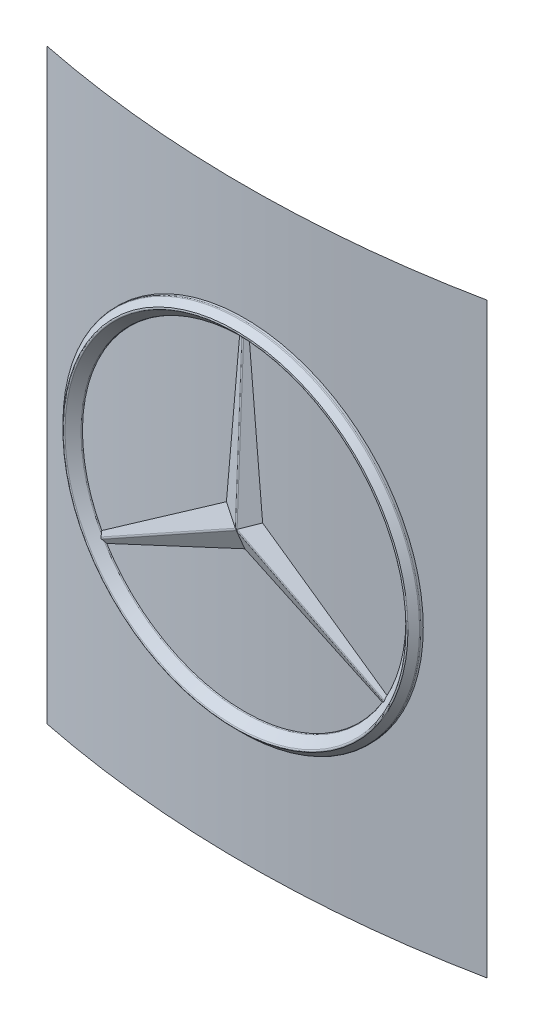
ISO-10303-21;
HEADER;
FILE_DESCRIPTION(('STEP AP214'),'2;1');
FILE_NAME('part.step','',(''),(''),'','','');
FILE_SCHEMA(('AUTOMOTIVE_DESIGN { 1 0 10303 214 1 1 1 1 }'));
ENDSEC;
DATA;
#1=APPLICATION_CONTEXT('core data for automotive mechanical design processes');
#2=APPLICATION_PROTOCOL_DEFINITION('international standard','automotive_design',2000,#1);
#3=PRODUCT_CONTEXT('',#1,'mechanical');
#4=PRODUCT('Part','Part','',(#3));
#5=PRODUCT_RELATED_PRODUCT_CATEGORY('part','',(#4));
#6=PRODUCT_DEFINITION_FORMATION('','',#4);
#7=PRODUCT_DEFINITION_CONTEXT('part definition',#1,'design');
#8=PRODUCT_DEFINITION('design','',#6,#7);
#9=PRODUCT_DEFINITION_SHAPE('','',#8);
#10=(LENGTH_UNIT() NAMED_UNIT(*) SI_UNIT(.MILLI.,.METRE.));
#11=(NAMED_UNIT(*) PLANE_ANGLE_UNIT() SI_UNIT($,.RADIAN.));
#12=(NAMED_UNIT(*) SI_UNIT($,.STERADIAN.) SOLID_ANGLE_UNIT());
#13=UNCERTAINTY_MEASURE_WITH_UNIT(LENGTH_MEASURE(1.E-05),#10,'distance_accuracy_value','');
#14=(GEOMETRIC_REPRESENTATION_CONTEXT(3) GLOBAL_UNCERTAINTY_ASSIGNED_CONTEXT((#13)) GLOBAL_UNIT_ASSIGNED_CONTEXT((#10,
#11,#12)) REPRESENTATION_CONTEXT('',''));
#15=CARTESIAN_POINT('',(0.,0.,0.));
#16=DIRECTION('',(0.,0.,1.));
#17=DIRECTION('',(1.,0.,0.));
#18=AXIS2_PLACEMENT_3D('',#15,#16,#17);
#19=CARTESIAN_POINT('',(0.,0.,-75.7500000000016));
#20=DIRECTION('',(0.,1.,0.));
#21=DIRECTION('',(0.,0.,1.));
#22=AXIS2_PLACEMENT_3D('',#19,#20,#21);
#23=CYLINDRICAL_SURFACE('',#22,75.7500000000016);
#24=CARTESIAN_POINT('',(0.,20.,-75.7500000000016));
#25=DIRECTION('',(0.,1.,0.));
#26=DIRECTION('',(0.,0.,1.));
#27=AXIS2_PLACEMENT_3D('',#24,#25,#26);
#28=CIRCLE('',#27,75.7500000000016);
#29=CARTESIAN_POINT('',(-15.,20.,-1.5));
#30=VERTEX_POINT('',#29);
#31=CARTESIAN_POINT('',(15.,20.,-1.5));
#32=VERTEX_POINT('',#31);
#33=EDGE_CURVE('E62',#30,#32,#28,.T.);
#34=ORIENTED_EDGE('',*,*,#33,.F.);
#35=DIRECTION('',(0.,1.,0.));
#36=VECTOR('',#35,1.);
#37=CARTESIAN_POINT('',(-15.,0.,-1.5));
#38=LINE('',#37,#36);
#39=CARTESIAN_POINT('',(-15.,-20.,-1.5));
#40=VERTEX_POINT('',#39);
#41=EDGE_CURVE('E54',#40,#30,#38,.T.);
#42=ORIENTED_EDGE('',*,*,#41,.F.);
#43=CARTESIAN_POINT('',(0.,-20.,-75.7500000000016));
#44=DIRECTION('',(0.,1.,0.));
#45=DIRECTION('',(0.,0.,1.));
#46=AXIS2_PLACEMENT_3D('',#43,#44,#45);
#47=CIRCLE('',#46,75.7500000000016);
#48=CARTESIAN_POINT('',(15.,-20.,-1.5));
#49=VERTEX_POINT('',#48);
#50=EDGE_CURVE('E72',#40,#49,#47,.T.);
#51=ORIENTED_EDGE('',*,*,#50,.T.);
#52=DIRECTION('',(0.,1.,0.));
#53=VECTOR('',#52,1.);
#54=CARTESIAN_POINT('',(15.,0.,-1.5));
#55=LINE('',#54,#53);
#56=EDGE_CURVE('E12',#49,#32,#55,.T.);
#57=ORIENTED_EDGE('',*,*,#56,.T.);
#58=EDGE_LOOP('',(#34,#42,#51,#57));
#59=FACE_BOUND('',#58,.T.);
#60=ADVANCED_FACE('F53',(#59),#23,.T.);
#61=OPEN_SHELL('',(#60));
#62=SHELL_BASED_SURFACE_MODEL('B2',(#61));
#63=CARTESIAN_POINT('',(-0.0322418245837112,-0.00177291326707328,0.194454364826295));
#64=DIRECTION('',(0.,0.,1.));
#65=DIRECTION('',(1.,0.,0.));
#66=AXIS2_PLACEMENT_3D('',#63,#64,#65);
#67=CYLINDRICAL_SURFACE('',#66,12.1805456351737);
#68=CARTESIAN_POINT('',(-0.0322418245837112,-0.00177291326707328,0.153033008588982));
#69=DIRECTION('',(0.,0.,-1.));
#70=DIRECTION('',(-1.,0.,0.));
#71=AXIS2_PLACEMENT_3D('',#68,#69,#70);
#72=CIRCLE('',#71,12.1805456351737);
#73=CARTESIAN_POINT('',(-12.2127874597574,-0.00177291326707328,0.153033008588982));
#74=VERTEX_POINT('',#73);
#75=EDGE_CURVE('E323',#74,#74,#72,.T.);
#76=ORIENTED_EDGE('',*,*,#75,.T.);
#77=EDGE_LOOP('',(#76));
#78=FACE_BOUND('',#77,.T.);
#79=CARTESIAN_POINT('',(-0.0322418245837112,-0.00177291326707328,0.));
#80=DIRECTION('',(0.,0.,-1.));
#81=DIRECTION('',(-1.,0.,0.));
#82=AXIS2_PLACEMENT_3D('',#79,#80,#81);
#83=CIRCLE('',#82,12.1805456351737);
#84=CARTESIAN_POINT('',(-12.2127874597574,-0.00177291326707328,0.));
#85=VERTEX_POINT('',#84);
#86=EDGE_CURVE('E549',#85,#85,#83,.F.);
#87=ORIENTED_EDGE('',*,*,#86,.T.);
#88=EDGE_LOOP('',(#87));
#89=FACE_BOUND('',#88,.T.);
#90=ADVANCED_FACE('F105',(#78,#89),#67,.T.);
#91=CARTESIAN_POINT('',(-0.0322418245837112,-0.00177291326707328,0.));
#92=DIRECTION('',(0.,0.,1.));
#93=DIRECTION('',(1.,0.,0.));
#94=AXIS2_PLACEMENT_3D('',#91,#92,#93);
#95=TOROIDAL_SURFACE('',#94,11.1414213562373,0.1);
#96=CARTESIAN_POINT('',(9.36425921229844,-5.79994105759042,0.));
#97=CARTESIAN_POINT('',(9.37122517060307,-5.78868533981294,0.00612965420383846));
#98=CARTESIAN_POINT('',(9.37862967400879,-5.77768262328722,0.0122388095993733));
#99=CARTESIAN_POINT('',(9.39429227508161,-5.75638691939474,0.0243253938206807));
#100=CARTESIAN_POINT('',(9.4025432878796,-5.74608907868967,0.0303034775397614));
#101=CARTESIAN_POINT('',(9.41998936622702,-5.72622045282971,0.0421384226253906));
#102=CARTESIAN_POINT('',(9.42918515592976,-5.71665023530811,0.0479951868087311));
#103=CARTESIAN_POINT('',(9.44382565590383,-5.70302351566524,0.0566392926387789));
#104=CARTESIAN_POINT('',(9.44886832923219,-5.69858683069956,0.0595080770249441));
#105=CARTESIAN_POINT('',(9.45926843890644,-5.69003603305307,0.0651713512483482));
#106=CARTESIAN_POINT('',(9.46462618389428,-5.68592224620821,0.0679657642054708));
#107=CARTESIAN_POINT('',(9.47015701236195,-5.68200629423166,0.0707106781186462));
#108=B_SPLINE_CURVE_WITH_KNOTS('',3,(#96,#97,#98,#99,#100,#101,#102,#103,#104,#105,#106,#107),
.UNSPECIFIED.,.F.,.F.,(4,2,2,2,2,4),(0.,0.0437599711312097,0.0871796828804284,0.130632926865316,
0.152531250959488,0.174451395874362),.UNSPECIFIED.);
#109=CARTESIAN_POINT('',(9.36425921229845,-5.79994105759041,0.));
#110=VERTEX_POINT('',#109);
#111=CARTESIAN_POINT('',(9.47015701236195,-5.68200629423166,0.0707106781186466));
#112=VERTEX_POINT('',#111);
#113=EDGE_CURVE('E312',#110,#112,#108,.T.);
#114=ORIENTED_EDGE('',*,*,#113,.F.);
#115=CARTESIAN_POINT('',(-0.0322418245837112,-0.00177291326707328,0.));
#116=DIRECTION('',(0.,0.,1.));
#117=DIRECTION('',(1.,0.,0.));
#118=AXIS2_PLACEMENT_3D('',#115,#116,#117);
#119=CIRCLE('',#118,11.0414213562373);
#120=CARTESIAN_POINT('',(-9.41986717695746,-5.81430040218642,0.));
#121=VERTEX_POINT('',#120);
#122=EDGE_CURVE('E553',#110,#121,#119,.F.);
#123=ORIENTED_EDGE('',*,*,#122,.T.);
#124=CARTESIAN_POINT('',(-9.52598173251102,-5.69646671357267,0.0707106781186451));
#125=CARTESIAN_POINT('',(-9.51715109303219,-5.7027300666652,0.0663234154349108));
#126=CARTESIAN_POINT('',(-9.5087445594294,-5.70946533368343,0.0618202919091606));
#127=CARTESIAN_POINT('',(-9.49268665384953,-5.72366192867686,0.0526560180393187));
#128=CARTESIAN_POINT('',(-9.48503405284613,-5.73112203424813,0.0479951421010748));
#129=CARTESIAN_POINT('',(-9.47044262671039,-5.74648817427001,0.0386255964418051));
#130=CARTESIAN_POINT('',(-9.46349690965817,-5.75438843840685,0.0339180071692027));
#131=CARTESIAN_POINT('',(-9.45018115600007,-5.77062364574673,0.0244325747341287));
#132=CARTESIAN_POINT('',(-9.4438112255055,-5.77895866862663,0.0196547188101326));
#133=CARTESIAN_POINT('',(-9.4346021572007,-5.79184815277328,0.012392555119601));
#134=CARTESIAN_POINT('',(-9.43155518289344,-5.79626546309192,0.00992525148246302));
#135=CARTESIAN_POINT('',(-9.4256022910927,-5.8052067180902,0.00497337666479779));
#136=CARTESIAN_POINT('',(-9.42269680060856,-5.80973093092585,0.00248877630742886));
#137=CARTESIAN_POINT('',(-9.41986717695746,-5.81430040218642,0.));
#138=B_SPLINE_CURVE_WITH_KNOTS('',3,(#124,#125,#126,#127,#128,#129,#130,#131,#132,#133,#134,
#135,#136,#137),.UNSPECIFIED.,.F.,.F.,(4,2,2,2,2,2,4),(0.,0.0349921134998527,0.0699262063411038,
0.104478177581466,0.139036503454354,0.156753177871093,0.174520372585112),.UNSPECIFIED.);
#139=CARTESIAN_POINT('',(-9.52598173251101,-5.69646671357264,0.0707106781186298));
#140=VERTEX_POINT('',#139);
#141=EDGE_CURVE('E317',#140,#121,#138,.T.);
#142=ORIENTED_EDGE('',*,*,#141,.F.);
#143=CARTESIAN_POINT('',(-0.0322418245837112,-0.00177291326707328,0.0707106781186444));
#144=DIRECTION('',(0.,0.,-1.));
#145=DIRECTION('',(-1.,0.,0.));
#146=AXIS2_PLACEMENT_3D('',#143,#144,#145);
#147=CIRCLE('',#146,11.0707106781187);
#148=EDGE_CURVE('E332',#112,#140,#147,.T.);
#149=ORIENTED_EDGE('',*,*,#148,.F.);
#150=EDGE_LOOP('',(#114,#123,#142,#149));
#151=FACE_BOUND('',#150,.T.);
#152=ADVANCED_FACE('F276',(#151),#95,.T.);
#153=CARTESIAN_POINT('',(-0.0322418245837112,-0.00177291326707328,0.));
#154=DIRECTION('',(0.,0.,1.));
#155=DIRECTION('',(1.,0.,0.));
#156=AXIS2_PLACEMENT_3D('',#153,#154,#155);
#157=TOROIDAL_SURFACE('',#156,11.1414213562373,0.1);
#158=CARTESIAN_POINT('',(0.298557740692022,11.0346919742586,0.));
#159=CARTESIAN_POINT('',(0.285324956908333,11.0351060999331,0.00613023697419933));
#160=CARTESIAN_POINT('',(0.272092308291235,11.0360266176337,0.012239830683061));
#161=CARTESIAN_POINT('',(0.24581545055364,11.038961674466,0.0243270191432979));
#162=CARTESIAN_POINT('',(0.232770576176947,11.0409676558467,0.0303052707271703));
#163=CARTESIAN_POINT('',(0.206839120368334,11.0461605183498,0.0421402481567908));
#164=CARTESIAN_POINT('',(0.193952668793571,11.0493483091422,0.0479968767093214));
#165=CARTESIAN_POINT('',(0.174831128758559,11.0552272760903,0.056640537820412));
#166=CARTESIAN_POINT('',(0.168467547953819,11.0573803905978,0.0595091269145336));
#167=CARTESIAN_POINT('',(0.155862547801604,11.0621202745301,0.0651719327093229));
#168=CARTESIAN_POINT('',(0.149621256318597,11.0647074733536,0.0679660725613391));
#169=CARTESIAN_POINT('',(0.143464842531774,11.0675433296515,0.0707106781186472));
#170=B_SPLINE_CURVE_WITH_KNOTS('',3,(#158,#159,#160,#161,#162,#163,#164,#165,#166,#167,#168,
#169),.UNSPECIFIED.,.F.,.F.,(4,2,2,2,2,4),(0.,0.0437670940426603,0.0871940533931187,
0.130654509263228,0.152556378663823,0.1744800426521),.UNSPECIFIED.);
#171=CARTESIAN_POINT('',(0.298557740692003,11.0346919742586,0.));
#172=VERTEX_POINT('',#171);
#173=CARTESIAN_POINT('',(0.143464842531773,11.0675433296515,0.0707106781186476));
#174=VERTEX_POINT('',#173);
#175=EDGE_CURVE('E248',#172,#174,#170,.T.);
#176=ORIENTED_EDGE('',*,*,#175,.F.);
#177=CARTESIAN_POINT('',(-0.0322418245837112,-0.00177291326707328,0.));
#178=DIRECTION('',(0.,0.,1.));
#179=DIRECTION('',(1.,0.,0.));
#180=AXIS2_PLACEMENT_3D('',#177,#178,#179);
#181=CIRCLE('',#180,11.0414213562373);
#182=CARTESIAN_POINT('',(9.6873696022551,-5.24029744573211,0.));
#183=VERTEX_POINT('',#182);
#184=EDGE_CURVE('E556',#172,#183,#181,.F.);
#185=ORIENTED_EDGE('',*,*,#184,.T.);
#186=CARTESIAN_POINT('',(9.63818400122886,-5.39097501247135,0.0707106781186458));
#187=CARTESIAN_POINT('',(9.6392047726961,-5.3802102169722,0.0663257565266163));
#188=CARTESIAN_POINT('',(9.64084581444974,-5.36957737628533,0.0618253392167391));
#189=CARTESIAN_POINT('',(9.64513324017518,-5.34860361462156,0.0526671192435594));
#190=CARTESIAN_POINT('',(9.64777794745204,-5.33826223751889,0.0480095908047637));
#191=CARTESIAN_POINT('',(9.65380926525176,-5.31797513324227,0.0386472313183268));
#192=CARTESIAN_POINT('',(9.65718744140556,-5.30802631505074,0.0339434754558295));
#193=CARTESIAN_POINT('',(9.66460695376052,-5.28841027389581,0.0244661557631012));
#194=CARTESIAN_POINT('',(9.66864841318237,-5.27874310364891,0.0196925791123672));
#195=CARTESIAN_POINT('',(9.67522623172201,-5.26433013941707,0.012427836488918));
#196=CARTESIAN_POINT('',(9.67754097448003,-5.25947316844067,0.00995347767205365));
#197=CARTESIAN_POINT('',(9.68233421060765,-5.24982864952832,0.00498748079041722));
#198=CARTESIAN_POINT('',(9.68481315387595,-5.24504134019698,0.00249581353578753));
#199=CARTESIAN_POINT('',(9.6873696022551,-5.24029744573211,0.));
#200=B_SPLINE_CURVE_WITH_KNOTS('',3,(#186,#187,#188,#189,#190,#191,#192,#193,#194,#195,#196,
#197,#198,#199),.UNSPECIFIED.,.F.,.F.,(4,2,2,2,2,2,4),(0.,0.0349525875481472,0.0698470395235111,
0.104359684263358,0.138878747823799,0.156642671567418,0.174457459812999),.UNSPECIFIED.);
#201=CARTESIAN_POINT('',(9.63818400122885,-5.39097501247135,0.0707106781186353));
#202=VERTEX_POINT('',#201);
#203=EDGE_CURVE('E282',#202,#183,#200,.T.);
#204=ORIENTED_EDGE('',*,*,#203,.F.);
#205=CARTESIAN_POINT('',(-0.0322418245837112,-0.00177291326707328,0.0707106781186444));
#206=DIRECTION('',(0.,0.,-1.));
#207=DIRECTION('',(-1.,0.,0.));
#208=AXIS2_PLACEMENT_3D('',#205,#206,#207);
#209=CIRCLE('',#208,11.0707106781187);
#210=EDGE_CURVE('E335',#174,#202,#209,.T.);
#211=ORIENTED_EDGE('',*,*,#210,.F.);
#212=EDGE_LOOP('',(#176,#185,#204,#211));
#213=FACE_BOUND('',#212,.T.);
#214=ADVANCED_FACE('F266',(#213),#157,.T.);
#215=CARTESIAN_POINT('',(-0.0322418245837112,-0.00177291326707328,0.));
#216=DIRECTION('',(0.,0.,1.));
#217=DIRECTION('',(1.,0.,0.));
#218=AXIS2_PLACEMENT_3D('',#215,#216,#217);
#219=TOROIDAL_SURFACE('',#218,11.1414213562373,0.1);
#220=CARTESIAN_POINT('',(-9.75985096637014,-5.22543120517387,0.));
#221=CARTESIAN_POINT('',(-9.75360159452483,-5.23710588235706,0.00613093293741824));
#222=CARTESIAN_POINT('',(-9.74779112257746,-5.24903338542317,0.0122410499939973));
#223=CARTESIAN_POINT('',(-9.73721212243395,-5.27327154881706,0.024328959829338));
#224=CARTESIAN_POINT('',(-9.73243585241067,-5.28557851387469,0.0303074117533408));
#225=CARTESIAN_POINT('',(-9.72398533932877,-5.31064499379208,0.0421424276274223));
#226=CARTESIAN_POINT('',(-9.72031194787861,-5.32340484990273,0.0479988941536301));
#227=CARTESIAN_POINT('',(-9.71585613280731,-5.34291221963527,0.0566420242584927));
#228=CARTESIAN_POINT('',(-9.71454354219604,-5.34950237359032,0.0595103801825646));
#229=CARTESIAN_POINT('',(-9.71235487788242,-5.36279338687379,0.0651726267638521));
#230=CARTESIAN_POINT('',(-9.71147923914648,-5.3694943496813,0.0679664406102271));
#231=CARTESIAN_POINT('',(-9.71086127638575,-5.37624595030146,0.0707106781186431));
#232=B_SPLINE_CURVE_WITH_KNOTS('',3,(#220,#221,#222,#223,#224,#225,#226,#227,#228,#229,#230,
#231),.UNSPECIFIED.,.F.,.F.,(4,2,2,2,2,4),(0.,0.0437756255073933,0.0872112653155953,
0.13068035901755,0.152586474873,0.174514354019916),.UNSPECIFIED.);
#233=CARTESIAN_POINT('',(-9.75985096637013,-5.22543120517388,0.));
#234=VERTEX_POINT('',#233);
#235=CARTESIAN_POINT('',(-9.71086127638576,-5.37624595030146,0.0707106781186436));
#236=VERTEX_POINT('',#235);
#237=EDGE_CURVE('E113',#234,#236,#232,.T.);
#238=ORIENTED_EDGE('',*,*,#237,.F.);
#239=CARTESIAN_POINT('',(-0.0322418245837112,-0.00177291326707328,0.));
#240=DIRECTION('',(0.,0.,1.));
#241=DIRECTION('',(1.,0.,0.));
#242=AXIS2_PLACEMENT_3D('',#239,#240,#241);
#243=CIRCLE('',#242,11.0414213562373);
#244=CARTESIAN_POINT('',(-0.363041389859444,11.0346919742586,0.));
#245=VERTEX_POINT('',#244);
#246=EDGE_CURVE('E51',#234,#245,#243,.F.);
#247=ORIENTED_EDGE('',*,*,#246,.T.);
#248=CARTESIAN_POINT('',(-0.207948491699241,11.0675433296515,0.0707106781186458));
#249=CARTESIAN_POINT('',(-0.217784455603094,11.0630369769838,0.0663246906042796));
#250=CARTESIAN_POINT('',(-0.227816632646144,11.0591338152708,0.0618230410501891));
#251=CARTESIAN_POINT('',(-0.248131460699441,11.0523442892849,0.0526620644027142));
#252=CARTESIAN_POINT('',(-0.258413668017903,11.0494562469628,0.0480030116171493));
#253=CARTESIAN_POINT('',(-0.279006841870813,11.0445208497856,0.0386373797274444));
#254=CARTESIAN_POINT('',(-0.289316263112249,11.0424646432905,0.0339318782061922));
#255=CARTESIAN_POINT('',(-0.3100232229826,11.0390676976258,0.0244508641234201));
#256=CARTESIAN_POINT('',(-0.320420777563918,11.0377270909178,0.0196753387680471));
#257=CARTESIAN_POINT('',(-0.336189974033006,11.0362077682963,0.0124117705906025));
#258=CARTESIAN_POINT('',(-0.341546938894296,11.0357810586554,0.00994062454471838));
#259=CARTESIAN_POINT('',(-0.352282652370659,11.0351036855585,0.00498105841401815));
#260=CARTESIAN_POINT('',(-0.357661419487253,11.0348535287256,0.00249260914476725));
#261=CARTESIAN_POINT('',(-0.363041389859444,11.0346919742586,0.));
#262=B_SPLINE_CURVE_WITH_KNOTS('',3,(#248,#249,#250,#251,#252,#253,#254,#255,#256,#257,#258,
#259,#260,#261),.UNSPECIFIED.,.F.,.F.,(4,2,2,2,2,2,4),(0.,0.0349705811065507,0.0698830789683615,
0.104413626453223,0.138950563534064,0.156692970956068,0.17448608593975),.UNSPECIFIED.);
#263=CARTESIAN_POINT('',(-0.207948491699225,11.0675433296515,0.0707106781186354));
#264=VERTEX_POINT('',#263);
#265=EDGE_CURVE('E247',#264,#245,#262,.T.);
#266=ORIENTED_EDGE('',*,*,#265,.F.);
#267=CARTESIAN_POINT('',(-0.0322418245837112,-0.00177291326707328,0.0707106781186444));
#268=DIRECTION('',(0.,0.,-1.));
#269=DIRECTION('',(-1.,0.,0.));
#270=AXIS2_PLACEMENT_3D('',#267,#268,#269);
#271=CIRCLE('',#270,11.0707106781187);
#272=EDGE_CURVE('E246',#236,#264,#271,.T.);
#273=ORIENTED_EDGE('',*,*,#272,.F.);
#274=EDGE_LOOP('',(#238,#247,#266,#273));
#275=FACE_BOUND('',#274,.T.);
#276=ADVANCED_FACE('F244',(#275),#219,.T.);
#277=CARTESIAN_POINT('',(-0.657827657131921,-0.362955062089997,0.41159511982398));
#278=DIRECTION('',(0.865311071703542,0.499587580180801,0.0406078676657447));
#279=DIRECTION('',(-0.499999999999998,0.86602540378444,0.));
#280=AXIS2_PLACEMENT_3D('',#277,#278,#279);
#281=CYLINDRICAL_SURFACE('',#280,0.15);
#282=CARTESIAN_POINT('',(0.0345090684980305,0.0367657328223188,0.444085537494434));
#283=DIRECTION('',(-0.865311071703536,-0.499587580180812,-0.0406078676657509));
#284=DIRECTION('',(0.500000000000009,-0.866025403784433,0.));
#285=AXIS2_PLACEMENT_3D('',#282,#283,#284);
#286=CIRCLE('',#285,0.15);
#287=CARTESIAN_POINT('',(0.0015572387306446,0.0825423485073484,0.583077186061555));
#288=VERTEX_POINT('',#287);
#289=CARTESIAN_POINT('',(-0.00185151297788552,0.0886940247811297,0.580031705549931));
#290=VERTEX_POINT('',#289);
#291=EDGE_CURVE('E381',#288,#290,#286,.T.);
#292=ORIENTED_EDGE('',*,*,#291,.F.);
#293=CARTESIAN_POINT('',(0.269204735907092,0.172267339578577,0.455099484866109));
#294=DIRECTION('',(0.421010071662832,0.0368336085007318,0.906307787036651));
#295=DIRECTION('',(0.758680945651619,0.533335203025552,-0.374107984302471));
#296=AXIS2_PLACEMENT_3D('',#293,#294,#295);
#297=ELLIPSE('',#296,0.357560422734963,0.15);
#298=CARTESIAN_POINT('',(0.0063345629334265,0.0934202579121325,0.58041586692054));
#299=VERTEX_POINT('',#298);
#300=EDGE_CURVE('E471',#299,#288,#297,.T.);
#301=ORIENTED_EDGE('',*,*,#300,.F.);
#302=DIRECTION('',(-0.865311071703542,-0.499587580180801,-0.0406078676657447));
#303=VECTOR('',#302,1.);
#304=CARTESIAN_POINT('',(-0.694188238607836,-0.311026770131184,0.547541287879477));
#305=LINE('',#304,#303);
#306=EDGE_CURVE('E479',#290,#299,#305,.F.);
#307=ORIENTED_EDGE('',*,*,#306,.F.);
#308=EDGE_LOOP('',(#292,#301,#307));
#309=FACE_BOUND('',#308,.T.);
#310=ADVANCED_FACE('F265',(#309),#281,.T.);
#311=CARTESIAN_POINT('',(-10.0956151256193,-6.12940684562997,0.));
#312=DIRECTION('',(0.178606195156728,-0.383022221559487,0.906307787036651));
#313=DIRECTION('',(0.,-0.921118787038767,-0.389281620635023));
#314=AXIS2_PLACEMENT_3D('',#311,#312,#313);
#315=PLANE('',#314);
#316=DIRECTION('',(-0.970173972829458,0.0848792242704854,0.227063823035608));
#317=VECTOR('',#316,1.);
#318=CARTESIAN_POINT('',(-8.86777731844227,0.761520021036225,2.67026137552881));
#319=LINE('',#318,#317);
#320=CARTESIAN_POINT('',(0.136453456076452,-0.0262480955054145,0.562871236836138));
#321=VERTEX_POINT('',#320);
#322=CARTESIAN_POINT('',(0.0628260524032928,-0.0198065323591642,0.580103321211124));
#323=VERTEX_POINT('',#322);
#324=EDGE_CURVE('E539',#321,#323,#319,.T.);
#325=ORIENTED_EDGE('',*,*,#324,.T.);
#326=DIRECTION('',(-0.865311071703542,-0.499587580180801,-0.0406078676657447));
#327=VECTOR('',#326,1.);
#328=CARTESIAN_POINT('',(-10.2049973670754,-5.94793714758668,0.0982483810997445));
#329=LINE('',#328,#327);
#330=CARTESIAN_POINT('',(0.061299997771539,-0.0206876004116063,0.580031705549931));
#331=VERTEX_POINT('',#330);
#332=EDGE_CURVE('E437',#323,#331,#329,.T.);
#333=ORIENTED_EDGE('',*,*,#332,.T.);
#334=CARTESIAN_POINT('',(0.0468447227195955,0.183827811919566,0.556717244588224));
#335=CARTESIAN_POINT('',(0.0898889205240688,0.124909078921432,0.635929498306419));
#336=CARTESIAN_POINT('',(0.16751985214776,0.0628719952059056,0.594412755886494));
#337=CARTESIAN_POINT('',(0.0438984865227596,0.176184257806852,0.558848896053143));
#338=CARTESIAN_POINT('',(0.087012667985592,0.117166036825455,0.633223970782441));
#339=CARTESIAN_POINT('',(0.16011581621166,0.0548840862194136,0.592496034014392));
#340=CARTESIAN_POINT('',(0.0408138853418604,0.168546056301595,0.560941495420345));
#341=CARTESIAN_POINT('',(0.0836052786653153,0.109391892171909,0.630609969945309));
#342=CARTESIAN_POINT('',(0.152376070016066,0.0471650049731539,0.590759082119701));
#343=CARTESIAN_POINT('',(0.0342397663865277,0.153252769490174,0.565024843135));
#344=CARTESIAN_POINT('',(0.075789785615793,0.0940455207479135,0.625664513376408));
#345=CARTESIAN_POINT('',(0.136279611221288,0.0323061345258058,0.587651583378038));
#346=CARTESIAN_POINT('',(0.0307499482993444,0.145597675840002,0.567015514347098));
#347=CARTESIAN_POINT('',(0.0713951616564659,0.0864590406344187,0.623324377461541));
#348=CARTESIAN_POINT('',(0.127922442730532,0.0251667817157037,0.586281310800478));
#349=CARTESIAN_POINT('',(0.0232165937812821,0.13020401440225,0.570880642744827));
#350=CARTESIAN_POINT('',(0.0615957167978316,0.0715093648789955,0.618937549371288));
#351=CARTESIAN_POINT('',(0.110600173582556,0.0114762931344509,0.583909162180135));
#352=CARTESIAN_POINT('',(0.019169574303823,0.122465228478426,0.572754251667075));
#353=CARTESIAN_POINT('',(0.0561947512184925,0.0641319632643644,0.616884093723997));
#354=CARTESIAN_POINT('',(0.101631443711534,0.0049293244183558,0.582909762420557));
#355=CARTESIAN_POINT('',(0.0102798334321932,0.106888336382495,0.576326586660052));
#356=CARTESIAN_POINT('',(0.0443639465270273,0.0496674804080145,0.613102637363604));
#357=CARTESIAN_POINT('',(0.0832265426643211,-0.00750558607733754,0.581281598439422));
#358=CARTESIAN_POINT('',(0.00543758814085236,0.0990502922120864,0.578025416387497));
#359=CARTESIAN_POINT('',(0.0379424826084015,0.0425650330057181,0.611366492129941));
#360=CARTESIAN_POINT('',(0.0737906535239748,-0.0133939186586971,0.580652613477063));
#361=CARTESIAN_POINT('',(-0.00218004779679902,0.0881974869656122,0.580133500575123));
#362=CARTESIAN_POINT('',(0.0282755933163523,0.0329716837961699,0.609217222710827));
#363=CARTESIAN_POINT('',(0.0607016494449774,-0.0210486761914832,0.579997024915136));
#364=CARTESIAN_POINT('',(-0.0043094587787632,0.0852878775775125,0.580675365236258));
#365=CARTESIAN_POINT('',(0.0256258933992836,0.0304367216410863,0.608668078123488));
#366=CARTESIAN_POINT('',(0.057190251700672,-0.0230533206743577,0.57984181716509));
#367=CARTESIAN_POINT('',(-0.00884068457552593,0.0794282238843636,0.581701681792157));
#368=CARTESIAN_POINT('',(0.0201260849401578,0.0253799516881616,0.607614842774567));
#369=CARTESIAN_POINT('',(0.0501348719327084,-0.0270066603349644,0.579561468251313));
#370=CARTESIAN_POINT('',(-0.0112424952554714,0.0764781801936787,0.582186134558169));
#371=CARTESIAN_POINT('',(0.0172758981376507,0.0228571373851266,0.607110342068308));
#372=CARTESIAN_POINT('',(0.0465908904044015,-0.0289553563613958,0.579436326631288));
#373=CARTESIAN_POINT('',(-0.0164247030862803,0.0705385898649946,0.583068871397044));
#374=CARTESIAN_POINT('',(0.0113286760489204,0.0178153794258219,0.606151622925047));
#375=CARTESIAN_POINT('',(0.0394873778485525,-0.0328179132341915,0.57920382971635));
#376=CARTESIAN_POINT('',(-0.0192047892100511,0.067549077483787,0.583467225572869));
#377=CARTESIAN_POINT('',(0.00823131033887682,0.0152950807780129,0.605696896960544));
#378=CARTESIAN_POINT('',(0.0359278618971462,-0.0347318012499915,0.579096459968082));
#379=CARTESIAN_POINT('',(-0.0253182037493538,0.0615600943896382,0.584119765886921));
#380=CARTESIAN_POINT('',(0.00170695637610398,0.0102550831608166,0.604852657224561));
#381=CARTESIAN_POINT('',(0.0288109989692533,-0.038563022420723,0.578879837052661));
#382=CARTESIAN_POINT('',(-0.0286515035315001,0.058560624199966,0.584373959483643));
#383=CARTESIAN_POINT('',(-0.00172179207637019,0.00773311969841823,0.604462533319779));
#384=CARTESIAN_POINT('',(0.0252536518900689,-0.0404803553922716,0.578770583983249));
#385=CARTESIAN_POINT('',(-0.0361868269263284,0.0526813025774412,0.584604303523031));
#386=CARTESIAN_POINT('',(-0.00906564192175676,0.0027265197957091,0.603793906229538));
#387=CARTESIAN_POINT('',(0.0181728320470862,-0.044375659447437,0.578519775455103));
#388=CARTESIAN_POINT('',(-0.0403888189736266,0.0498014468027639,0.584580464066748));
#389=CARTESIAN_POINT('',(-0.0129861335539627,0.000237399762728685,0.603514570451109));
#390=CARTESIAN_POINT('',(0.0146493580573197,-0.0463536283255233,0.578378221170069));
#391=CARTESIAN_POINT('',(-0.0474693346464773,0.0460466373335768,0.584120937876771));
#392=CARTESIAN_POINT('',(-0.0192888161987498,-0.00323440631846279,0.60328939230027));
#393=CARTESIAN_POINT('',(0.00941968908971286,-0.0494121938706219,0.578116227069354));
#394=CARTESIAN_POINT('',(-0.0499592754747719,0.0448891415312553,0.583897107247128));
#395=CARTESIAN_POINT('',(-0.0214636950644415,-0.00435000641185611,0.603246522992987));
#396=CARTESIAN_POINT('',(0.00768561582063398,-0.0504470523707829,0.578020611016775));
#397=CARTESIAN_POINT('',(-0.0550701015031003,0.0429300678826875,0.583278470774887));
#398=CARTESIAN_POINT('',(-0.0258858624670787,-0.00640034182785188,0.60325149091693));
#399=CARTESIAN_POINT('',(0.00423765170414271,-0.0525481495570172,0.577812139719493));
#400=CARTESIAN_POINT('',(-0.0576909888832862,0.0421284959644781,0.582883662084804));
#401=CARTESIAN_POINT('',(-0.0281359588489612,-0.00733607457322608,0.603299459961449));
#402=CARTESIAN_POINT('',(0.00252376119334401,-0.0536143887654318,0.577699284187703));
#403=CARTESIAN_POINT('',(-0.0627744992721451,0.0409753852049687,0.581964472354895));
#404=CARTESIAN_POINT('',(-0.032547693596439,-0.00895977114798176,0.603482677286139));
#405=CARTESIAN_POINT('',(-0.000889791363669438,-0.0557675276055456,0.577462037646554));
#406=CARTESIAN_POINT('',(-0.0652371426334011,0.040623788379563,0.581440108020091));
#407=CARTESIAN_POINT('',(-0.0347113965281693,-0.00964797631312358,0.60361823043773));
#408=CARTESIAN_POINT('',(-0.00258945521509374,-0.0568544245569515,0.577337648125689));
#409=CARTESIAN_POINT('',(-0.0697702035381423,0.0402850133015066,0.580357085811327));
#410=CARTESIAN_POINT('',(-0.0388162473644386,-0.010803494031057,0.603938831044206));
#411=CARTESIAN_POINT('',(-0.00598836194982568,-0.0590287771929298,0.577088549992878));
#412=CARTESIAN_POINT('',(-0.0718406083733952,0.0402978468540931,0.579798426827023));
#413=CARTESIAN_POINT('',(-0.0407575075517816,-0.0112703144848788,0.604124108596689));
#414=CARTESIAN_POINT('',(-0.00768760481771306,-0.0601162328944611,0.576963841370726));
#415=CARTESIAN_POINT('',(-0.0774532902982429,0.0406252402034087,0.578172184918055));
#416=CARTESIAN_POINT('',(-0.0462455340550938,-0.0124648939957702,0.604700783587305));
#417=CARTESIAN_POINT('',(-0.012805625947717,-0.0633464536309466,0.576607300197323));
#418=CARTESIAN_POINT('',(-0.0803993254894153,0.0412284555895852,0.577153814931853));
#419=CARTESIAN_POINT('',(-0.0494339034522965,-0.0129801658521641,0.605111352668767));
#420=CARTESIAN_POINT('',(-0.0162461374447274,-0.0654580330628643,0.576392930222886));
#421=CARTESIAN_POINT('',(-0.0843016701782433,0.0422852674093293,0.575706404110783));
#422=CARTESIAN_POINT('',(-0.0540020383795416,-0.0136096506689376,0.605745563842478));
#423=CARTESIAN_POINT('',(-0.021715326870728,-0.068616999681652,0.576135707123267));
#424=CARTESIAN_POINT('',(-0.0855655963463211,0.0426895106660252,0.575213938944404));
#425=CARTESIAN_POINT('',(-0.0555663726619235,-0.0138008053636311,0.605973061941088));
#426=CARTESIAN_POINT('',(-0.023705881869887,-0.0697271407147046,0.576058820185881));
#427=CARTESIAN_POINT('',(-0.087892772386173,0.0435249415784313,0.574272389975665));
#428=CARTESIAN_POINT('',(-0.0585761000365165,-0.0141232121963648,0.606429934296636));
#429=CARTESIAN_POINT('',(-0.0277243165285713,-0.0718806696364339,0.575940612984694));
#430=CARTESIAN_POINT('',(-0.0889559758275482,0.0439561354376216,0.573823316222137));
#431=CARTESIAN_POINT('',(-0.0600206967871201,-0.0142542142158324,0.606659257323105));
#432=CARTESIAN_POINT('',(-0.0297522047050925,-0.0729240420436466,0.575899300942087));
#433=CARTESIAN_POINT('',(-0.0919321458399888,0.0452608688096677,0.572528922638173));
#434=CARTESIAN_POINT('',(-0.0642301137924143,-0.0145738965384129,0.607353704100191));
#435=CARTESIAN_POINT('',(-0.0358866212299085,-0.0759401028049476,0.575833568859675));
#436=CARTESIAN_POINT('',(-0.093635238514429,0.0461467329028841,0.571735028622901));
#437=CARTESIAN_POINT('',(-0.0668589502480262,-0.0146878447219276,0.607823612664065));
#438=CARTESIAN_POINT('',(-0.0400494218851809,-0.0778019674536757,0.575867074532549));
#439=CARTESIAN_POINT('',(-0.0967418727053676,0.0479248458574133,0.570224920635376));
#440=CARTESIAN_POINT('',(-0.0719259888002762,-0.0147411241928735,0.608799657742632));
#441=CARTESIAN_POINT('',(-0.0485112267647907,-0.081197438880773,0.576099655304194));
#442=CARTESIAN_POINT('',(-0.0981448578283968,0.0488171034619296,0.569508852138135));
#443=CARTESIAN_POINT('',(-0.0743615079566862,-0.0146791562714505,0.609305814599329));
#444=CARTESIAN_POINT('',(-0.0528104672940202,-0.0827304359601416,0.576299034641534));
#445=CARTESIAN_POINT('',(-0.100759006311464,0.050613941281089,0.568123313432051));
#446=CARTESIAN_POINT('',(-0.0790935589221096,-0.0143815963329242,0.610364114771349));
#447=CARTESIAN_POINT('',(-0.0615249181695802,-0.0854527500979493,0.576865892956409));
#448=CARTESIAN_POINT('',(-0.101969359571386,0.0515185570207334,0.567454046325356));
#449=CARTESIAN_POINT('',(-0.081387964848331,-0.0141444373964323,0.610916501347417));
#450=CARTESIAN_POINT('',(-0.0659405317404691,-0.0866406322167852,0.577234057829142));
#451=CARTESIAN_POINT('',(-0.103134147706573,0.0524294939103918,0.566794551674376));
#452=CARTESIAN_POINT('',(-0.0836281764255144,-0.0138222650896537,0.611494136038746));
#453=CARTESIAN_POINT('',(-0.0703900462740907,-0.0876440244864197,0.577686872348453));
#454=(BOUNDED_SURFACE() B_SPLINE_SURFACE(3,2,((#334,#335,#336),(#337,#338,#339),(#340,#341,
#342),(#343,#344,#345),(#346,#347,#348),(#349,#350,#351),(#352,#353,#354),(#355,#356,#357),
(#358,#359,#360),(#361,#362,#363),(#364,#365,#366),(#367,#368,#369),(#370,#371,#372),(#373,#374,
#375),(#376,#377,#378),(#379,#380,#381),(#382,#383,#384),(#385,#386,#387),(#388,#389,#390),
(#391,#392,#393),(#394,#395,#396),(#397,#398,#399),(#400,#401,#402),(#403,#404,#405),(#406,#407,
#408),(#409,#410,#411),(#412,#413,#414),(#415,#416,#417),(#418,#419,#420),(#421,#422,#423),
(#424,#425,#426),(#427,#428,#429),(#430,#431,#432),(#433,#434,#435),(#436,#437,#438),(#439,#440,
#441),(#442,#443,#444),(#445,#446,#447),(#448,#449,#450),(#451,#452,#453)),.UNSPECIFIED.,.F.,
.F.,.F.) B_SPLINE_SURFACE_WITH_KNOTS((4,2,2,2,2,2,2,2,2,2,2,2,2,2,2,2,2,2,2,4),(3,3),(0.,
0.0331663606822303,0.0663574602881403,0.0997663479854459,0.133155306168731,0.145293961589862,
0.157432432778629,0.16956098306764,0.181688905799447,0.193816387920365,0.199880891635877,
0.205945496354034,0.212009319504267,0.218073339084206,0.230196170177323,0.237036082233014,
0.243877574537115,0.257541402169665,0.271230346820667,0.284975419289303),(0.,1.),
.UNSPECIFIED.) GEOMETRIC_REPRESENTATION_ITEM() RATIONAL_B_SPLINE_SURFACE(((1.,0.812309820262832,
1.),(1.,0.821200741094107,1.),(1.,0.829818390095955,1.),(1.,0.846490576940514,1.),(1.,
0.854544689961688,1.),(1.,0.870110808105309,1.),(1.,0.877618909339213,1.),(1.,0.891964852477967,
1.),(1.,0.898803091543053,1.),(1.,0.907470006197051,1.),(1.,0.909717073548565,1.),(1.,
0.914040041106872,1.),(1.,0.916115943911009,1.),(1.,0.920018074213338,1.),(1.,0.921844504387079,
1.),(1.,0.925081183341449,1.),(1.,0.926491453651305,1.),(1.,0.928494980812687,1.),(1.,
0.929088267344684,1.),(1.,0.928652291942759,1.),(1.,0.928285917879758,1.),(1.,0.926986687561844,
1.),(1.,0.926053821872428,1.),(1.,0.923712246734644,1.),(1.,0.922303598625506,1.),(1.,
0.919296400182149,1.),(1.,0.917697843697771,1.),(1.,0.912964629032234,1.),(1.,0.909891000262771,
1.),(1.,0.905456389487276,1.),(1.,0.9039327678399,1.),(1.,0.900998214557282,1.),(1.,
0.899587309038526,1.),(1.,0.895497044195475,1.),(1.,0.892955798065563,1.),(1.,0.888081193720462,
1.),(1.,0.885748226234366,1.),(1.,0.881199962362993,1.),(1.,0.878985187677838,1.),(1.,
0.876790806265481,1.))) REPRESENTATION_ITEM('') SURFACE());
#455=CARTESIAN_POINT('',(0.16751985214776,0.0628719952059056,0.594412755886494));
#456=CARTESIAN_POINT('',(0.16011581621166,0.0548840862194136,0.592496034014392));
#457=CARTESIAN_POINT('',(0.152376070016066,0.0471650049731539,0.590759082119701));
#458=CARTESIAN_POINT('',(0.136279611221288,0.0323061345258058,0.587651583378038));
#459=CARTESIAN_POINT('',(0.127922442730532,0.0251667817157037,0.586281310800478));
#460=CARTESIAN_POINT('',(0.110600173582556,0.0114762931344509,0.583909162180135));
#461=CARTESIAN_POINT('',(0.101631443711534,0.0049293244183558,0.582909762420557));
#462=CARTESIAN_POINT('',(0.0832265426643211,-0.00750558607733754,0.581281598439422));
#463=CARTESIAN_POINT('',(0.0737906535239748,-0.0133939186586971,0.580652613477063));
#464=CARTESIAN_POINT('',(0.0607016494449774,-0.0210486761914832,0.579997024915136));
#465=CARTESIAN_POINT('',(0.057190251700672,-0.0230533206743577,0.57984181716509));
#466=CARTESIAN_POINT('',(0.0501348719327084,-0.0270066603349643,0.579561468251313));
#467=CARTESIAN_POINT('',(0.0465908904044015,-0.0289553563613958,0.579436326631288));
#468=CARTESIAN_POINT('',(0.0394873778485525,-0.0328179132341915,0.57920382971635));
#469=CARTESIAN_POINT('',(0.0359278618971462,-0.0347318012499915,0.579096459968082));
#470=CARTESIAN_POINT('',(0.0288109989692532,-0.038563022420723,0.578879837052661));
#471=CARTESIAN_POINT('',(0.0252536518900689,-0.0404803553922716,0.578770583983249));
#472=CARTESIAN_POINT('',(0.0181728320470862,-0.044375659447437,0.578519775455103));
#473=CARTESIAN_POINT('',(0.0146493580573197,-0.0463536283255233,0.578378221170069));
#474=CARTESIAN_POINT('',(0.00941968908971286,-0.0494121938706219,0.578116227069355));
#475=CARTESIAN_POINT('',(0.00768561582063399,-0.0504470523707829,0.578020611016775));
#476=CARTESIAN_POINT('',(0.00423765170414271,-0.0525481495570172,0.577812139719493));
#477=CARTESIAN_POINT('',(0.002523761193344,-0.0536143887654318,0.577699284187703));
#478=CARTESIAN_POINT('',(-0.000889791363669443,-0.0557675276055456,0.577462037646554));
#479=CARTESIAN_POINT('',(-0.00258945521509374,-0.0568544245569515,0.577337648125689));
#480=CARTESIAN_POINT('',(-0.00598836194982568,-0.0590287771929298,0.577088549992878));
#481=CARTESIAN_POINT('',(-0.00768760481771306,-0.0601162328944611,0.576963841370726));
#482=CARTESIAN_POINT('',(-0.012805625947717,-0.0633464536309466,0.576607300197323));
#483=CARTESIAN_POINT('',(-0.0162461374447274,-0.0654580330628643,0.576392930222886));
#484=CARTESIAN_POINT('',(-0.021715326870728,-0.0686169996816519,0.576135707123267));
#485=CARTESIAN_POINT('',(-0.023705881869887,-0.0697271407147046,0.576058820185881));
#486=CARTESIAN_POINT('',(-0.0277243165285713,-0.0718806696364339,0.575940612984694));
#487=CARTESIAN_POINT('',(-0.0297522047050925,-0.0729240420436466,0.575899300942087));
#488=CARTESIAN_POINT('',(-0.0358866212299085,-0.0759401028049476,0.575833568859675));
#489=CARTESIAN_POINT('',(-0.0400494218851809,-0.0778019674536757,0.575867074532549));
#490=CARTESIAN_POINT('',(-0.0485112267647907,-0.081197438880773,0.576099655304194));
#491=CARTESIAN_POINT('',(-0.0528104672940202,-0.0827304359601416,0.576299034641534));
#492=CARTESIAN_POINT('',(-0.0615249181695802,-0.0854527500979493,0.576865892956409));
#493=CARTESIAN_POINT('',(-0.0659405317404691,-0.0866406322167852,0.577234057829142));
#494=CARTESIAN_POINT('',(-0.0703900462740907,-0.0876440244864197,0.577686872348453));
#495=B_SPLINE_CURVE_WITH_KNOTS('',3,(#455,#456,#457,#458,#459,#460,#461,#462,#463,#464,#465,
#466,#467,#468,#469,#470,#471,#472,#473,#474,#475,#476,#477,#478,#479,#480,#481,#482,#483,#484,
#485,#486,#487,#488,#489,#490,#491,#492,#493,#494),.UNSPECIFIED.,.F.,.F.,(4,2,2,2,2,2,2,2,2,2,2,
2,2,2,2,2,2,2,2,4),(0.,0.0331663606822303,0.0663574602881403,0.0997663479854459,
0.133155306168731,0.145293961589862,0.157432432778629,0.16956098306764,0.181688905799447,
0.193816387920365,0.199880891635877,0.205945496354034,0.212009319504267,0.218073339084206,
0.230196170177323,0.237036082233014,0.243877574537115,0.257541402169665,0.271230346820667,
0.284975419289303),.UNSPECIFIED.);
#496=CARTESIAN_POINT('',(0.0443185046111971,-0.0301900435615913,0.579362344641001));
#497=VERTEX_POINT('',#496);
#498=EDGE_CURVE('E454',#331,#497,#495,.T.);
#499=ORIENTED_EDGE('',*,*,#498,.T.);
#500=CARTESIAN_POINT('',(0.407511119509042,-0.255664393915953,0.412498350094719));
#501=DIRECTION('',(0.178606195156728,-0.383022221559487,0.906307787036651));
#502=DIRECTION('',(-0.851817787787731,0.400823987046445,0.337263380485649));
#503=AXIS2_PLACEMENT_3D('',#500,#501,#502);
#504=ELLIPSE('',#503,0.48528010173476,0.15);
#505=EDGE_CURVE('E500',#497,#321,#504,.F.);
#506=ORIENTED_EDGE('',*,*,#505,.T.);
#507=EDGE_LOOP('',(#325,#333,#499,#506));
#508=FACE_BOUND('',#507,.T.);
#509=ADVANCED_FACE('F406',(#508),#315,.T.);
#510=CARTESIAN_POINT('',(-1.26523582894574,0.722562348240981,0.));
#511=DIRECTION('',(-0.242403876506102,0.346188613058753,0.906307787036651));
#512=DIRECTION('',(0.,-0.934168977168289,0.356830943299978));
#513=AXIS2_PLACEMENT_3D('',#510,#511,#512);
#514=PLANE('',#513);
#515=CARTESIAN_POINT('',(3.93462429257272,-5.66704485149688,3.83145279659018));
#516=DIRECTION('',(-0.242403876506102,0.346188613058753,0.906307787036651));
#517=DIRECTION('',(0.519836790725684,-0.742403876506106,0.422618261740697));
#518=AXIS2_PLACEMENT_3D('',#515,#516,#517);
#519=ELLIPSE('',#518,16.3646975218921,13.1202385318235);
#520=CARTESIAN_POINT('',(-9.69819125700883,-5.50949033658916,0.124995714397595));
#521=VERTEX_POINT('',#520);
#522=EDGE_CURVE('E515',#521,#236,#519,.F.);
#523=ORIENTED_EDGE('',*,*,#522,.F.);
#524=DIRECTION('',(-0.865311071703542,-0.499587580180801,-0.0406078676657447));
#525=VECTOR('',#524,1.);
#526=CARTESIAN_POINT('',(-0.694188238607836,-0.311026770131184,0.547541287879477));
#527=LINE('',#526,#525);
#528=CARTESIAN_POINT('',(-0.0828940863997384,0.0419040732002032,0.576228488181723));
#529=VERTEX_POINT('',#528);
#530=EDGE_CURVE('E476',#521,#529,#527,.F.);
#531=ORIENTED_EDGE('',*,*,#530,.T.);
#532=CARTESIAN_POINT('',(-0.0322418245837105,0.495572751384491,0.416485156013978));
#533=DIRECTION('',(-0.242403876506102,0.346188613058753,0.906307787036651));
#534=DIRECTION('',(-0.0787851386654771,-0.938107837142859,0.337263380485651));
#535=AXIS2_PLACEMENT_3D('',#532,#533,#534);
#536=ELLIPSE('',#535,0.485280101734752,0.15);
#537=CARTESIAN_POINT('',(-0.0953933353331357,0.0471534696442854,0.57088025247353));
#538=VERTEX_POINT('',#537);
#539=EDGE_CURVE('E489',#529,#538,#536,.F.);
#540=ORIENTED_EDGE('',*,*,#539,.T.);
#541=DIRECTION('',(-0.797712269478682,0.460559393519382,-0.389281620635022));
#542=VECTOR('',#541,1.);
#543=CARTESIAN_POINT('',(-1.26523582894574,0.722562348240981,0.));
#544=LINE('',#543,#542);
#545=CARTESIAN_POINT('',(-1.26523582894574,0.722562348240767,0.));
#546=VERTEX_POINT('',#545);
#547=EDGE_CURVE('E239',#538,#546,#544,.T.);
#548=ORIENTED_EDGE('',*,*,#547,.T.);
#549=DIRECTION('',(-0.819152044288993,-0.573576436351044,0.));
#550=VECTOR('',#549,1.);
#551=CARTESIAN_POINT('',(-1.26523582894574,0.722562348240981,0.));
#552=LINE('',#551,#550);
#553=EDGE_CURVE('E229',#546,#234,#552,.T.);
#554=ORIENTED_EDGE('',*,*,#553,.T.);
#555=ORIENTED_EDGE('',*,*,#237,.T.);
#556=EDGE_LOOP('',(#523,#531,#540,#548,#554,#555));
#557=FACE_BOUND('',#556,.T.);
#558=ADVANCED_FACE('F236',(#557),#514,.T.);
#559=CARTESIAN_POINT('',(-0.0322418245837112,-0.00177291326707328,0.));
#560=DIRECTION('',(0.,0.,1.));
#561=DIRECTION('',(1.,0.,0.));
#562=AXIS2_PLACEMENT_3D('',#559,#560,#561);
#563=CONICAL_SURFACE('',#562,11.,0.785398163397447);
#564=CARTESIAN_POINT('',(-0.0322418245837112,-0.00177291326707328,0.616789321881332));
#565=DIRECTION('',(0.,0.,-1.));
#566=DIRECTION('',(-1.,0.,0.));
#567=AXIS2_PLACEMENT_3D('',#564,#565,#566);
#568=CIRCLE('',#567,11.6167893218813);
#569=CARTESIAN_POINT('',(-11.6490311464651,-0.00177291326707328,0.616789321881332));
#570=VERTEX_POINT('',#569);
#571=EDGE_CURVE('E339',#570,#570,#568,.F.);
#572=ORIENTED_EDGE('',*,*,#571,.T.);
#573=EDGE_LOOP('',(#572));
#574=FACE_BOUND('',#573,.T.);
#575=CARTESIAN_POINT('',(2.88862582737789,6.26204798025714,3.82146291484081));
#576=DIRECTION('',(-0.178606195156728,-0.383022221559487,0.906307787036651));
#577=DIRECTION('',(0.383022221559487,0.821393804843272,0.422618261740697));
#578=AXIS2_PLACEMENT_3D('',#575,#576,#577);
#579=ELLIPSE('',#578,16.3536749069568,13.1114012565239);
#580=CARTESIAN_POINT('',(9.56405011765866,-5.61511573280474,0.117483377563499));
#581=VERTEX_POINT('',#580);
#582=EDGE_CURVE('E521',#581,#112,#579,.F.);
#583=ORIENTED_EDGE('',*,*,#582,.T.);
#584=ORIENTED_EDGE('',*,*,#148,.T.);
#585=CARTESIAN_POINT('',(-2.95507818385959,6.26626988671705,3.83145279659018));
#586=DIRECTION('',(0.178606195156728,-0.383022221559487,0.906307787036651));
#587=DIRECTION('',(-0.383022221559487,0.821393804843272,0.422618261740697));
#588=AXIS2_PLACEMENT_3D('',#585,#586,#587);
#589=ELLIPSE('',#588,16.3646975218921,13.1202385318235);
#590=CARTESIAN_POINT('',(-9.63503974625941,-5.6188719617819,0.124995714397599));
#591=VERTEX_POINT('',#590);
#592=EDGE_CURVE('E517',#140,#591,#589,.F.);
#593=ORIENTED_EDGE('',*,*,#592,.T.);
#594=CARTESIAN_POINT('',(-9.6350397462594,-5.61887196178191,0.124995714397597));
#595=CARTESIAN_POINT('',(-9.63997082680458,-5.61533896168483,0.127468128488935));
#596=CARTESIAN_POINT('',(-9.64478954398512,-5.61142385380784,0.129654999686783));
#597=CARTESIAN_POINT('',(-9.65406018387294,-5.60288021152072,0.13336228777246));
#598=CARTESIAN_POINT('',(-9.65851099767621,-5.59824963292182,0.134880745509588));
#599=CARTESIAN_POINT('',(-9.66689125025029,-5.58832580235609,0.137145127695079));
#600=CARTESIAN_POINT('',(-9.67081835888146,-5.58302977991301,0.137887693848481));
#601=CARTESIAN_POINT('',(-9.67796955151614,-5.57195049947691,0.138532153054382));
#602=CARTESIAN_POINT('',(-9.68119508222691,-5.56616827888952,0.138435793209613));
#603=CARTESIAN_POINT('',(-9.68669176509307,-5.55463587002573,0.13744370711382));
#604=CARTESIAN_POINT('',(-9.6890066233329,-5.54890241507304,0.136593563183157));
#605=CARTESIAN_POINT('',(-9.69290029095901,-5.53732774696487,0.134210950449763));
#606=CARTESIAN_POINT('',(-9.69447848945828,-5.5314864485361,0.132677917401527));
#607=CARTESIAN_POINT('',(-9.69683689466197,-5.52023778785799,0.129143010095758));
#608=CARTESIAN_POINT('',(-9.69766424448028,-5.51482803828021,0.127180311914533));
#609=CARTESIAN_POINT('',(-9.69819125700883,-5.50949033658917,0.124995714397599));
#610=B_SPLINE_CURVE_WITH_KNOTS('',3,(#594,#595,#596,#597,#598,#599,#600,#601,#602,#603,#604,
#605,#606,#607,#608,#609),.UNSPECIFIED.,.F.,.F.,(4,2,2,2,2,2,2,4),(0.,0.0196553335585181,
0.0393679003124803,0.0591654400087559,0.078921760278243,0.0975591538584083,0.116211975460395,
0.133590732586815),.UNSPECIFIED.);
#611=EDGE_CURVE('E350',#591,#521,#610,.T.);
#612=ORIENTED_EDGE('',*,*,#611,.T.);
#613=ORIENTED_EDGE('',*,*,#522,.T.);
#614=ORIENTED_EDGE('',*,*,#272,.T.);
#615=CARTESIAN_POINT('',(6.85493482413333,-0.604322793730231,3.82601545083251));
#616=DIRECTION('',(-0.421010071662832,0.0368336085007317,0.906307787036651));
#617=DIRECTION('',(0.902859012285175,-0.0789899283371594,0.422618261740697));
#618=AXIS2_PLACEMENT_3D('',#615,#616,#617);
#619=ELLIPSE('',#618,16.3586980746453,13.1154285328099);
#620=CARTESIAN_POINT('',(-0.0953933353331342,11.1189546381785,0.120906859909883));
#621=VERTEX_POINT('',#620);
#622=EDGE_CURVE('E526',#264,#621,#619,.F.);
#623=ORIENTED_EDGE('',*,*,#622,.T.);
#624=CARTESIAN_POINT('',(-0.095393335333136,11.1189546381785,0.120906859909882));
#625=CARTESIAN_POINT('',(-0.0898681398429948,11.1214585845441,0.123379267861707));
#626=CARTESIAN_POINT('',(-0.0840682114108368,11.1236741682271,0.125566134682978));
#627=CARTESIAN_POINT('',(-0.0720339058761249,11.1274309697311,0.129273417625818));
#628=CARTESIAN_POINT('',(-0.065798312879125,11.1289702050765,0.130791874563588));
#629=CARTESIAN_POINT('',(-0.05301392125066,11.1312658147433,0.133056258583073));
#630=CARTESIAN_POINT('',(-0.0464638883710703,11.1320187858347,0.133798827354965));
#631=CARTESIAN_POINT('',(-0.0332933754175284,11.1326722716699,0.13444329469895));
#632=CARTESIAN_POINT('',(-0.026673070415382,11.1325745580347,0.134346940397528));
#633=CARTESIAN_POINT('',(-0.0139373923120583,11.131568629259,0.133354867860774));
#634=CARTESIAN_POINT('',(-0.00781465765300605,11.1307066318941,0.132504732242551));
#635=CARTESIAN_POINT('',(0.00415611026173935,11.1282913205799,0.130122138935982));
#636=CARTESIAN_POINT('',(0.0100039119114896,11.1267374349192,0.128589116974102));
#637=CARTESIAN_POINT('',(0.0209248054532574,11.1231555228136,0.125054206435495));
#638=CARTESIAN_POINT('',(0.0260235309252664,11.1211671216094,0.123091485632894));
#639=CARTESIAN_POINT('',(0.0309096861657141,11.1189546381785,0.120906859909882));
#640=B_SPLINE_CURVE_WITH_KNOTS('',3,(#624,#625,#626,#627,#628,#629,#630,#631,#632,#633,#634,
#635,#636,#637,#638,#639),.UNSPECIFIED.,.F.,.F.,(4,2,2,2,2,2,2,4),(0.,0.0196553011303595,
0.0393678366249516,0.059165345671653,0.0789216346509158,0.0975589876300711,0.116211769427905,
0.133590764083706),.UNSPECIFIED.);
#641=CARTESIAN_POINT('',(0.0309096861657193,11.1189546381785,0.12090685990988));
#642=VERTEX_POINT('',#641);
#643=EDGE_CURVE('E482',#621,#642,#640,.T.);
#644=ORIENTED_EDGE('',*,*,#643,.T.);
#645=CARTESIAN_POINT('',(-6.91941847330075,-0.604322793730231,3.82601545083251));
#646=DIRECTION('',(0.421010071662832,0.0368336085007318,0.906307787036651));
#647=DIRECTION('',(-0.902859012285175,-0.0789899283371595,0.422618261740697));
#648=AXIS2_PLACEMENT_3D('',#645,#646,#647);
#649=ELLIPSE('',#648,16.3586980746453,13.1154285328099);
#650=EDGE_CURVE('E523',#642,#174,#649,.F.);
#651=ORIENTED_EDGE('',*,*,#650,.T.);
#652=ORIENTED_EDGE('',*,*,#210,.T.);
#653=CARTESIAN_POINT('',(-3.99643601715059,-5.66322894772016,3.82146291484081));
#654=DIRECTION('',(0.242403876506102,0.346188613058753,0.906307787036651));
#655=DIRECTION('',(-0.519836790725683,-0.742403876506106,0.422618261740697));
#656=AXIS2_PLACEMENT_3D('',#653,#654,#655);
#657=ELLIPSE('',#656,16.3536749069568,13.1114012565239);
#658=CARTESIAN_POINT('',(9.62720162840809,-5.505734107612,0.117483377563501));
#659=VERTEX_POINT('',#658);
#660=EDGE_CURVE('E519',#202,#659,#657,.F.);
#661=ORIENTED_EDGE('',*,*,#660,.T.);
#662=CARTESIAN_POINT('',(9.62720162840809,-5.505734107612,0.117483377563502));
#663=CARTESIAN_POINT('',(9.62660752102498,-5.51177103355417,0.119955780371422));
#664=CARTESIAN_POINT('',(9.62562631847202,-5.51790170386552,0.122142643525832));
#665=CARTESIAN_POINT('',(9.62286267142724,-5.5302021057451,0.125849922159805));
#666=CARTESIAN_POINT('',(9.62107790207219,-5.53637189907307,0.127368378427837));
#667=CARTESIAN_POINT('',(9.616673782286,-5.54859129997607,0.129632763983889));
#668=CARTESIAN_POINT('',(9.61405086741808,-5.55464027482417,0.130375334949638));
#669=CARTESIAN_POINT('',(9.6080315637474,-5.56637300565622,0.131019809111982));
#670=CARTESIAN_POINT('',(9.60463679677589,-5.57205749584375,0.130923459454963));
#671=CARTESIAN_POINT('',(9.59739781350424,-5.58258393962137,0.12993139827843));
#672=CARTESIAN_POINT('',(9.59358994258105,-5.58745537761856,0.129081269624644));
#673=CARTESIAN_POINT('',(9.58551285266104,-5.59661469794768,0.126698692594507));
#674=CARTESIAN_POINT('',(9.58124325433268,-5.60090209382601,0.125165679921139));
#675=CARTESIAN_POINT('',(9.57268073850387,-5.60856894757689,0.121630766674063));
#676=CARTESIAN_POINT('',(9.56840931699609,-5.61199040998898,0.119668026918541));
#677=CARTESIAN_POINT('',(9.56405011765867,-5.61511573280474,0.117483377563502));
#678=B_SPLINE_CURVE_WITH_KNOTS('',3,(#662,#663,#664,#665,#666,#667,#668,#669,#670,#671,#672,
#673,#674,#675,#676,#677),.UNSPECIFIED.,.F.,.F.,(4,2,2,2,2,2,2,4),(0.,0.0196552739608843,
0.0393677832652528,0.0591652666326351,0.0789215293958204,0.097558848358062,0.116211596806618,
0.13359079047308),.UNSPECIFIED.);
#679=EDGE_CURVE('E424',#659,#581,#678,.T.);
#680=ORIENTED_EDGE('',*,*,#679,.T.);
#681=EDGE_LOOP('',(#583,#584,#593,#612,#613,#614,#623,#644,#651,#652,#661,#680));
#682=FACE_BOUND('',#681,.T.);
#683=ADVANCED_FACE('F417',(#574,#682),#563,.F.);
#684=CARTESIAN_POINT('',(-0.0322418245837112,-0.00177291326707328,0.687499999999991));
#685=DIRECTION('',(0.,0.,-1.));
#686=DIRECTION('',(-1.,0.,0.));
#687=AXIS2_PLACEMENT_3D('',#684,#685,#686);
#688=CONICAL_SURFACE('',#687,11.6875,0.785398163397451);
#689=CARTESIAN_POINT('',(-0.0322418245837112,-0.00177291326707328,0.223743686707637));
#690=DIRECTION('',(0.,0.,1.));
#691=DIRECTION('',(1.,0.,0.));
#692=AXIS2_PLACEMENT_3D('',#689,#690,#691);
#693=CIRCLE('',#692,12.1512563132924);
#694=CARTESIAN_POINT('',(12.1190144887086,-0.00177291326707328,0.223743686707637));
#695=VERTEX_POINT('',#694);
#696=EDGE_CURVE('E326',#695,#695,#693,.T.);
#697=ORIENTED_EDGE('',*,*,#696,.T.);
#698=EDGE_LOOP('',(#697));
#699=FACE_BOUND('',#698,.T.);
#700=CARTESIAN_POINT('',(-0.0322418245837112,-0.00177291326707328,0.616789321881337));
#701=DIRECTION('',(0.,0.,1.));
#702=DIRECTION('',(1.,0.,0.));
#703=AXIS2_PLACEMENT_3D('',#700,#701,#702);
#704=CIRCLE('',#703,11.7582106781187);
#705=CARTESIAN_POINT('',(11.7259688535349,-0.00177291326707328,0.616789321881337));
#706=VERTEX_POINT('',#705);
#707=EDGE_CURVE('E329',#706,#706,#704,.F.);
#708=ORIENTED_EDGE('',*,*,#707,.T.);
#709=EDGE_LOOP('',(#708));
#710=FACE_BOUND('',#709,.T.);
#711=ADVANCED_FACE('F296',(#699,#710),#688,.T.);
#712=CARTESIAN_POINT('',(1.20265959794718,0.700760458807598,0.));
#713=DIRECTION('',(0.421010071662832,0.0368336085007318,0.906307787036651));
#714=DIRECTION('',(0.906923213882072,0.,-0.421295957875));
#715=AXIS2_PLACEMENT_3D('',#712,#713,#714);
#716=PLANE('',#715);
#717=DIRECTION('',(0.411579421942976,0.882634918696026,-0.227063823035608));
#718=VECTOR('',#717,1.);
#719=CARTESIAN_POINT('',(0.0737274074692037,0.23794467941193,0.543235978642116));
#720=LINE('',#719,#718);
#721=CARTESIAN_POINT('',(0.0309096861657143,0.146121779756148,0.566858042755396));
#722=VERTEX_POINT('',#721);
#723=EDGE_CURVE('E241',#299,#722,#720,.T.);
#724=ORIENTED_EDGE('',*,*,#723,.F.);
#725=ORIENTED_EDGE('',*,*,#300,.T.);
#726=CARTESIAN_POINT('',(0.0468447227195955,0.183827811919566,0.556717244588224));
#727=CARTESIAN_POINT('',(0.0898889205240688,0.124909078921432,0.635929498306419));
#728=CARTESIAN_POINT('',(0.16751985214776,0.0628719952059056,0.594412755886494));
#729=CARTESIAN_POINT('',(0.0438984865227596,0.176184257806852,0.558848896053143));
#730=CARTESIAN_POINT('',(0.087012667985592,0.117166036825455,0.633223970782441));
#731=CARTESIAN_POINT('',(0.16011581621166,0.0548840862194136,0.592496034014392));
#732=CARTESIAN_POINT('',(0.0408138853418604,0.168546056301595,0.560941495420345));
#733=CARTESIAN_POINT('',(0.0836052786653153,0.109391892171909,0.630609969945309));
#734=CARTESIAN_POINT('',(0.152376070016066,0.0471650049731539,0.590759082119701));
#735=CARTESIAN_POINT('',(0.0342397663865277,0.153252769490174,0.565024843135));
#736=CARTESIAN_POINT('',(0.075789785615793,0.0940455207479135,0.625664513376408));
#737=CARTESIAN_POINT('',(0.136279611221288,0.0323061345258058,0.587651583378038));
#738=CARTESIAN_POINT('',(0.0307499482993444,0.145597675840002,0.567015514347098));
#739=CARTESIAN_POINT('',(0.0713951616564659,0.0864590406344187,0.623324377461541));
#740=CARTESIAN_POINT('',(0.127922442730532,0.0251667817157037,0.586281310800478));
#741=CARTESIAN_POINT('',(0.0232165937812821,0.13020401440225,0.570880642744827));
#742=CARTESIAN_POINT('',(0.0615957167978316,0.0715093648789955,0.618937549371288));
#743=CARTESIAN_POINT('',(0.110600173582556,0.0114762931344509,0.583909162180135));
#744=CARTESIAN_POINT('',(0.019169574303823,0.122465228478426,0.572754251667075));
#745=CARTESIAN_POINT('',(0.0561947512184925,0.0641319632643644,0.616884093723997));
#746=CARTESIAN_POINT('',(0.101631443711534,0.0049293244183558,0.582909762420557));
#747=CARTESIAN_POINT('',(0.0102798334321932,0.106888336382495,0.576326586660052));
#748=CARTESIAN_POINT('',(0.0443639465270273,0.0496674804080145,0.613102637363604));
#749=CARTESIAN_POINT('',(0.0832265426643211,-0.00750558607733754,0.581281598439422));
#750=CARTESIAN_POINT('',(0.00543758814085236,0.0990502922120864,0.578025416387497));
#751=CARTESIAN_POINT('',(0.0379424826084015,0.0425650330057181,0.611366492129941));
#752=CARTESIAN_POINT('',(0.0737906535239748,-0.0133939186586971,0.580652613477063));
#753=CARTESIAN_POINT('',(-0.00218004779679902,0.0881974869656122,0.580133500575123));
#754=CARTESIAN_POINT('',(0.0282755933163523,0.0329716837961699,0.609217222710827));
#755=CARTESIAN_POINT('',(0.0607016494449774,-0.0210486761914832,0.579997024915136));
#756=CARTESIAN_POINT('',(-0.0043094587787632,0.0852878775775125,0.580675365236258));
#757=CARTESIAN_POINT('',(0.0256258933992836,0.0304367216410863,0.608668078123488));
#758=CARTESIAN_POINT('',(0.057190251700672,-0.0230533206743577,0.57984181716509));
#759=CARTESIAN_POINT('',(-0.00884068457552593,0.0794282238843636,0.581701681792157));
#760=CARTESIAN_POINT('',(0.0201260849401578,0.0253799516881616,0.607614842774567));
#761=CARTESIAN_POINT('',(0.0501348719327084,-0.0270066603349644,0.579561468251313));
#762=CARTESIAN_POINT('',(-0.0112424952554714,0.0764781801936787,0.582186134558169));
#763=CARTESIAN_POINT('',(0.0172758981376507,0.0228571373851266,0.607110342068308));
#764=CARTESIAN_POINT('',(0.0465908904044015,-0.0289553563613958,0.579436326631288));
#765=CARTESIAN_POINT('',(-0.0164247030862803,0.0705385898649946,0.583068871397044));
#766=CARTESIAN_POINT('',(0.0113286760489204,0.0178153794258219,0.606151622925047));
#767=CARTESIAN_POINT('',(0.0394873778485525,-0.0328179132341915,0.57920382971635));
#768=CARTESIAN_POINT('',(-0.0192047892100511,0.067549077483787,0.583467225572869));
#769=CARTESIAN_POINT('',(0.00823131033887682,0.0152950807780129,0.605696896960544));
#770=CARTESIAN_POINT('',(0.0359278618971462,-0.0347318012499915,0.579096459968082));
#771=CARTESIAN_POINT('',(-0.0253182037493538,0.0615600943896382,0.584119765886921));
#772=CARTESIAN_POINT('',(0.00170695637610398,0.0102550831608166,0.604852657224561));
#773=CARTESIAN_POINT('',(0.0288109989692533,-0.038563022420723,0.578879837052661));
#774=CARTESIAN_POINT('',(-0.0286515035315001,0.058560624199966,0.584373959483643));
#775=CARTESIAN_POINT('',(-0.00172179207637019,0.00773311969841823,0.604462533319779));
#776=CARTESIAN_POINT('',(0.0252536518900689,-0.0404803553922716,0.578770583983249));
#777=CARTESIAN_POINT('',(-0.0361868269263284,0.0526813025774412,0.584604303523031));
#778=CARTESIAN_POINT('',(-0.00906564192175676,0.0027265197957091,0.603793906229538));
#779=CARTESIAN_POINT('',(0.0181728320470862,-0.044375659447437,0.578519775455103));
#780=CARTESIAN_POINT('',(-0.0403888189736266,0.0498014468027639,0.584580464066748));
#781=CARTESIAN_POINT('',(-0.0129861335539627,0.000237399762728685,0.603514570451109));
#782=CARTESIAN_POINT('',(0.0146493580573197,-0.0463536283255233,0.578378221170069));
#783=CARTESIAN_POINT('',(-0.0474693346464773,0.0460466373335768,0.584120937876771));
#784=CARTESIAN_POINT('',(-0.0192888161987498,-0.00323440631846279,0.60328939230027));
#785=CARTESIAN_POINT('',(0.00941968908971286,-0.0494121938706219,0.578116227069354));
#786=CARTESIAN_POINT('',(-0.0499592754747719,0.0448891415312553,0.583897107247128));
#787=CARTESIAN_POINT('',(-0.0214636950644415,-0.00435000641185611,0.603246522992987));
#788=CARTESIAN_POINT('',(0.00768561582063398,-0.0504470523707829,0.578020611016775));
#789=CARTESIAN_POINT('',(-0.0550701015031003,0.0429300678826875,0.583278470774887));
#790=CARTESIAN_POINT('',(-0.0258858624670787,-0.00640034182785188,0.60325149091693));
#791=CARTESIAN_POINT('',(0.00423765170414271,-0.0525481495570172,0.577812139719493));
#792=CARTESIAN_POINT('',(-0.0576909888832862,0.0421284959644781,0.582883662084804));
#793=CARTESIAN_POINT('',(-0.0281359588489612,-0.00733607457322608,0.603299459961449));
#794=CARTESIAN_POINT('',(0.00252376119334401,-0.0536143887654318,0.577699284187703));
#795=CARTESIAN_POINT('',(-0.0627744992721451,0.0409753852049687,0.581964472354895));
#796=CARTESIAN_POINT('',(-0.032547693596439,-0.00895977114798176,0.603482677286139));
#797=CARTESIAN_POINT('',(-0.000889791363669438,-0.0557675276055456,0.577462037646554));
#798=CARTESIAN_POINT('',(-0.0652371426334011,0.040623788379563,0.581440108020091));
#799=CARTESIAN_POINT('',(-0.0347113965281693,-0.00964797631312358,0.60361823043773));
#800=CARTESIAN_POINT('',(-0.00258945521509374,-0.0568544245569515,0.577337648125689));
#801=CARTESIAN_POINT('',(-0.0697702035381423,0.0402850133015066,0.580357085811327));
#802=CARTESIAN_POINT('',(-0.0388162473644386,-0.010803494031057,0.603938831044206));
#803=CARTESIAN_POINT('',(-0.00598836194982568,-0.0590287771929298,0.577088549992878));
#804=CARTESIAN_POINT('',(-0.0718406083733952,0.0402978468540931,0.579798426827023));
#805=CARTESIAN_POINT('',(-0.0407575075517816,-0.0112703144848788,0.604124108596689));
#806=CARTESIAN_POINT('',(-0.00768760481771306,-0.0601162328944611,0.576963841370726));
#807=CARTESIAN_POINT('',(-0.0774532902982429,0.0406252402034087,0.578172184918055));
#808=CARTESIAN_POINT('',(-0.0462455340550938,-0.0124648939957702,0.604700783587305));
#809=CARTESIAN_POINT('',(-0.012805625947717,-0.0633464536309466,0.576607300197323));
#810=CARTESIAN_POINT('',(-0.0803993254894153,0.0412284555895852,0.577153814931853));
#811=CARTESIAN_POINT('',(-0.0494339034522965,-0.0129801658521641,0.605111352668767));
#812=CARTESIAN_POINT('',(-0.0162461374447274,-0.0654580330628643,0.576392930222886));
#813=CARTESIAN_POINT('',(-0.0843016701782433,0.0422852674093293,0.575706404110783));
#814=CARTESIAN_POINT('',(-0.0540020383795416,-0.0136096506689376,0.605745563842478));
#815=CARTESIAN_POINT('',(-0.021715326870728,-0.068616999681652,0.576135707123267));
#816=CARTESIAN_POINT('',(-0.0855655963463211,0.0426895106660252,0.575213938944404));
#817=CARTESIAN_POINT('',(-0.0555663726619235,-0.0138008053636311,0.605973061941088));
#818=CARTESIAN_POINT('',(-0.023705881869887,-0.0697271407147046,0.576058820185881));
#819=CARTESIAN_POINT('',(-0.087892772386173,0.0435249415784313,0.574272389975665));
#820=CARTESIAN_POINT('',(-0.0585761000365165,-0.0141232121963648,0.606429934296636));
#821=CARTESIAN_POINT('',(-0.0277243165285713,-0.0718806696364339,0.575940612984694));
#822=CARTESIAN_POINT('',(-0.0889559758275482,0.0439561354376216,0.573823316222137));
#823=CARTESIAN_POINT('',(-0.0600206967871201,-0.0142542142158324,0.606659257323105));
#824=CARTESIAN_POINT('',(-0.0297522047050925,-0.0729240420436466,0.575899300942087));
#825=CARTESIAN_POINT('',(-0.0919321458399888,0.0452608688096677,0.572528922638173));
#826=CARTESIAN_POINT('',(-0.0642301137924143,-0.0145738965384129,0.607353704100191));
#827=CARTESIAN_POINT('',(-0.0358866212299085,-0.0759401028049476,0.575833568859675));
#828=CARTESIAN_POINT('',(-0.093635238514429,0.0461467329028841,0.571735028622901));
#829=CARTESIAN_POINT('',(-0.0668589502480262,-0.0146878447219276,0.607823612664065));
#830=CARTESIAN_POINT('',(-0.0400494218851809,-0.0778019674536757,0.575867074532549));
#831=CARTESIAN_POINT('',(-0.0967418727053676,0.0479248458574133,0.570224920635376));
#832=CARTESIAN_POINT('',(-0.0719259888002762,-0.0147411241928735,0.608799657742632));
#833=CARTESIAN_POINT('',(-0.0485112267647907,-0.081197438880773,0.576099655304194));
#834=CARTESIAN_POINT('',(-0.0981448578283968,0.0488171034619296,0.569508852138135));
#835=CARTESIAN_POINT('',(-0.0743615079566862,-0.0146791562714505,0.609305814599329));
#836=CARTESIAN_POINT('',(-0.0528104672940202,-0.0827304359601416,0.576299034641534));
#837=CARTESIAN_POINT('',(-0.100759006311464,0.050613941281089,0.568123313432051));
#838=CARTESIAN_POINT('',(-0.0790935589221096,-0.0143815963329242,0.610364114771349));
#839=CARTESIAN_POINT('',(-0.0615249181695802,-0.0854527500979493,0.576865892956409));
#840=CARTESIAN_POINT('',(-0.101969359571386,0.0515185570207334,0.567454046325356));
#841=CARTESIAN_POINT('',(-0.081387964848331,-0.0141444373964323,0.610916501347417));
#842=CARTESIAN_POINT('',(-0.0659405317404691,-0.0866406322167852,0.577234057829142));
#843=CARTESIAN_POINT('',(-0.103134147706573,0.0524294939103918,0.566794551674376));
#844=CARTESIAN_POINT('',(-0.0836281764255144,-0.0138222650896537,0.611494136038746));
#845=CARTESIAN_POINT('',(-0.0703900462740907,-0.0876440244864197,0.577686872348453));
#846=(BOUNDED_SURFACE() B_SPLINE_SURFACE(3,2,((#726,#727,#728),(#729,#730,#731),(#732,#733,
#734),(#735,#736,#737),(#738,#739,#740),(#741,#742,#743),(#744,#745,#746),(#747,#748,#749),
(#750,#751,#752),(#753,#754,#755),(#756,#757,#758),(#759,#760,#761),(#762,#763,#764),(#765,#766,
#767),(#768,#769,#770),(#771,#772,#773),(#774,#775,#776),(#777,#778,#779),(#780,#781,#782),
(#783,#784,#785),(#786,#787,#788),(#789,#790,#791),(#792,#793,#794),(#795,#796,#797),(#798,#799,
#800),(#801,#802,#803),(#804,#805,#806),(#807,#808,#809),(#810,#811,#812),(#813,#814,#815),
(#816,#817,#818),(#819,#820,#821),(#822,#823,#824),(#825,#826,#827),(#828,#829,#830),(#831,#832,
#833),(#834,#835,#836),(#837,#838,#839),(#840,#841,#842),(#843,#844,#845)),.UNSPECIFIED.,.F.,
.F.,.F.) B_SPLINE_SURFACE_WITH_KNOTS((4,2,2,2,2,2,2,2,2,2,2,2,2,2,2,2,2,2,2,4),(3,3),(0.,
0.0331663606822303,0.0663574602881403,0.0997663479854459,0.133155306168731,0.145293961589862,
0.157432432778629,0.16956098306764,0.181688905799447,0.193816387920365,0.199880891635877,
0.205945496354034,0.212009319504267,0.218073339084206,0.230196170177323,0.237036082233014,
0.243877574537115,0.257541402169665,0.271230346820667,0.284975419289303),(0.,1.),
.UNSPECIFIED.) GEOMETRIC_REPRESENTATION_ITEM() RATIONAL_B_SPLINE_SURFACE(((1.,0.812309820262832,
1.),(1.,0.821200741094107,1.),(1.,0.829818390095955,1.),(1.,0.846490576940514,1.),(1.,
0.854544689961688,1.),(1.,0.870110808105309,1.),(1.,0.877618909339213,1.),(1.,0.891964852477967,
1.),(1.,0.898803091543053,1.),(1.,0.907470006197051,1.),(1.,0.909717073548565,1.),(1.,
0.914040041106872,1.),(1.,0.916115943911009,1.),(1.,0.920018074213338,1.),(1.,0.921844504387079,
1.),(1.,0.925081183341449,1.),(1.,0.926491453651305,1.),(1.,0.928494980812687,1.),(1.,
0.929088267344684,1.),(1.,0.928652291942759,1.),(1.,0.928285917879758,1.),(1.,0.926986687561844,
1.),(1.,0.926053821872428,1.),(1.,0.923712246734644,1.),(1.,0.922303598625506,1.),(1.,
0.919296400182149,1.),(1.,0.917697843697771,1.),(1.,0.912964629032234,1.),(1.,0.909891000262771,
1.),(1.,0.905456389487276,1.),(1.,0.9039327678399,1.),(1.,0.900998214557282,1.),(1.,
0.899587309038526,1.),(1.,0.895497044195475,1.),(1.,0.892955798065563,1.),(1.,0.888081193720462,
1.),(1.,0.885748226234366,1.),(1.,0.881199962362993,1.),(1.,0.878985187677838,1.),(1.,
0.876790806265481,1.))) REPRESENTATION_ITEM('') SURFACE());
#847=CARTESIAN_POINT('',(0.00155723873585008,0.0825423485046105,0.583077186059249));
#848=CARTESIAN_POINT('',(-0.00150499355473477,0.0750573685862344,0.584803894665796));
#849=CARTESIAN_POINT('',(-0.00440030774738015,0.0673596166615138,0.586461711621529));
#850=CARTESIAN_POINT('',(-0.00926010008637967,0.0513578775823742,0.589369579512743));
#851=CARTESIAN_POINT('',(-0.0111941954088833,0.0430426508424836,0.590605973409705));
#852=CARTESIAN_POINT('',(-0.0127547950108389,0.0302834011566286,0.591849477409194));
#853=CARTESIAN_POINT('',(-0.0130499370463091,0.0259637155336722,0.592162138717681));
#854=CARTESIAN_POINT('',(-0.0130696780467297,0.0173582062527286,0.592521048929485));
#855=CARTESIAN_POINT('',(-0.0128008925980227,0.0130725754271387,0.592570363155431));
#856=CARTESIAN_POINT('',(-0.0116017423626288,0.00456752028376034,0.592358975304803));
#857=CARTESIAN_POINT('',(-0.010667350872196,0.000348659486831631,0.592096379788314));
#858=CARTESIAN_POINT('',(-0.00806365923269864,-0.00791359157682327,0.591222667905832));
#859=CARTESIAN_POINT('',(-0.00637919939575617,-0.0119513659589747,0.590604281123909));
#860=CARTESIAN_POINT('',(-0.00430362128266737,-0.0157625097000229,0.589794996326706));
#861=B_SPLINE_CURVE_WITH_KNOTS('',3,(#847,#848,#849,#850,#851,#852,#853,#854,#855,#856,#857,
#858,#859,#860),.UNSPECIFIED.,.F.,.F.,(4,2,2,2,2,2,4),(0.,0.0249997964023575,0.050746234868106,
0.0637296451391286,0.0765615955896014,0.0894718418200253,0.102655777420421),.UNSPECIFIED.);
#862=CARTESIAN_POINT('',(-0.0105354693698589,0.000321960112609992,0.592036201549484));
#863=VERTEX_POINT('',#862);
#864=EDGE_CURVE('E342',#288,#863,#861,.T.);
#865=ORIENTED_EDGE('',*,*,#864,.T.);
#866=DIRECTION('',(0.797712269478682,0.460559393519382,-0.389281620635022));
#867=VECTOR('',#866,1.);
#868=CARTESIAN_POINT('',(1.20265959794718,0.700760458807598,0.));
#869=LINE('',#868,#867);
#870=CARTESIAN_POINT('',(1.20265959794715,0.700760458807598,0.));
#871=VERTEX_POINT('',#870);
#872=EDGE_CURVE('E545',#863,#871,#869,.T.);
#873=ORIENTED_EDGE('',*,*,#872,.T.);
#874=DIRECTION('',(-0.0871557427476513,0.996194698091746,0.));
#875=VECTOR('',#874,1.);
#876=CARTESIAN_POINT('',(1.20265959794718,0.700760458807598,0.));
#877=LINE('',#876,#875);
#878=EDGE_CURVE('E529',#871,#172,#877,.T.);
#879=ORIENTED_EDGE('',*,*,#878,.T.);
#880=ORIENTED_EDGE('',*,*,#175,.T.);
#881=ORIENTED_EDGE('',*,*,#650,.F.);
#882=DIRECTION('',(0.,0.999175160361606,-0.0406078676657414));
#883=VECTOR('',#882,1.);
#884=CARTESIAN_POINT('',(0.0309096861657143,0.722845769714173,0.543419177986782));
#885=LINE('',#884,#883);
#886=EDGE_CURVE('E506',#642,#722,#885,.F.);
#887=ORIENTED_EDGE('',*,*,#886,.T.);
#888=EDGE_LOOP('',(#724,#725,#865,#873,#879,#880,#881,#887));
#889=FACE_BOUND('',#888,.T.);
#890=ADVANCED_FACE('F292',(#889),#716,.T.);
#891=CARTESIAN_POINT('',(1.20265959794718,0.700760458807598,0.));
#892=DIRECTION('',(0.242403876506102,0.346188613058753,0.906307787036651));
#893=DIRECTION('',(0.,-0.934168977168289,0.356830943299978));
#894=AXIS2_PLACEMENT_3D('',#891,#892,#893);
#895=PLANE('',#894);
#896=ORIENTED_EDGE('',*,*,#872,.F.);
#897=CARTESIAN_POINT('',(0.0606491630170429,-0.0196072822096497,0.580609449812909));
#898=CARTESIAN_POINT('',(0.051850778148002,-0.0187068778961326,0.582618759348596));
#899=CARTESIAN_POINT('',(0.0429792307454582,-0.0174684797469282,0.584518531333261));
#900=CARTESIAN_POINT('',(0.0256094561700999,-0.0139141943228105,0.587806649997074));
#901=CARTESIAN_POINT('',(0.0171074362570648,-0.0116259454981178,0.589206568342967));
#902=CARTESIAN_POINT('',(0.00438679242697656,-0.00697831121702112,0.590833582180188));
#903=CARTESIAN_POINT('',(1.64336662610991E-05,-0.00514780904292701,0.591303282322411));
#904=CARTESIAN_POINT('',(-0.00853536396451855,-0.000925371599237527,0.591977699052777));
#905=CARTESIAN_POINT('',(-0.0127134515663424,0.00147381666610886,0.592178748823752));
#906=CARTESIAN_POINT('',(-0.0167000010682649,0.00420404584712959,0.59220211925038));
#907=B_SPLINE_CURVE_WITH_KNOTS('',3,(#897,#898,#899,#900,#901,#902,#903,#904,#905,#906),
.UNSPECIFIED.,.F.,.F.,(4,2,2,2,4),(0.,0.0273303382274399,0.053979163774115,0.0682238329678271,
0.0826610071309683),.UNSPECIFIED.);
#908=CARTESIAN_POINT('',(0.0606491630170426,-0.0196072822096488,0.580609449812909));
#909=VERTEX_POINT('',#908);
#910=EDGE_CURVE('E343',#909,#863,#907,.T.);
#911=ORIENTED_EDGE('',*,*,#910,.F.);
#912=CARTESIAN_POINT('',(0.262544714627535,0.168422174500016,0.454786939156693));
#913=DIRECTION('',(0.242403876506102,0.346188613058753,0.906307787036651));
#914=DIRECTION('',(0.841222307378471,0.390369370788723,-0.374107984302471));
#915=AXIS2_PLACEMENT_3D('',#912,#913,#914);
#916=ELLIPSE('',#915,0.357560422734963,0.15);
#917=EDGE_CURVE('E468',#909,#323,#916,.T.);
#918=ORIENTED_EDGE('',*,*,#917,.T.);
#919=ORIENTED_EDGE('',*,*,#324,.F.);
#920=DIRECTION('',(0.865311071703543,-0.499587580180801,-0.0406078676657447));
#921=VECTOR('',#920,1.);
#922=CARTESIAN_POINT('',(0.640283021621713,-0.317134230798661,0.53922720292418));
#923=LINE('',#922,#921);
#924=EDGE_CURVE('E509',#321,#659,#923,.T.);
#925=ORIENTED_EDGE('',*,*,#924,.T.);
#926=ORIENTED_EDGE('',*,*,#660,.F.);
#927=ORIENTED_EDGE('',*,*,#203,.T.);
#928=DIRECTION('',(-0.819152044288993,0.573576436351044,0.));
#929=VECTOR('',#928,1.);
#930=CARTESIAN_POINT('',(1.20265959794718,0.700760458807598,0.));
#931=LINE('',#930,#929);
#932=EDGE_CURVE('E127',#183,#871,#931,.T.);
#933=ORIENTED_EDGE('',*,*,#932,.T.);
#934=EDGE_LOOP('',(#896,#911,#918,#919,#925,#926,#927,#933));
#935=FACE_BOUND('',#934,.T.);
#936=ADVANCED_FACE('F295',(#935),#895,.T.);
#937=EDGE_CURVE('E486',#722,#290,#536,.F.);
#938=ORIENTED_EDGE('',*,*,#937,.T.);
#939=ORIENTED_EDGE('',*,*,#306,.T.);
#940=ORIENTED_EDGE('',*,*,#723,.T.);
#941=EDGE_LOOP('',(#938,#939,#940));
#942=FACE_BOUND('',#941,.T.);
#943=ADVANCED_FACE('F259',(#942),#514,.T.);
#944=CARTESIAN_POINT('',(-0.0124071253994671,-0.0861455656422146,0.566893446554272));
#945=VERTEX_POINT('',#944);
#946=CARTESIAN_POINT('',(-0.00334066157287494,-0.0573351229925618,0.577282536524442));
#947=VERTEX_POINT('',#946);
#948=EDGE_CURVE('E495',#945,#947,#504,.F.);
#949=ORIENTED_EDGE('',*,*,#948,.T.);
#950=CARTESIAN_POINT('',(0.16751985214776,0.0628719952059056,0.594412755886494));
#951=CARTESIAN_POINT('',(0.16011581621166,0.0548840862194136,0.592496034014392));
#952=CARTESIAN_POINT('',(0.152376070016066,0.0471650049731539,0.590759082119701));
#953=CARTESIAN_POINT('',(0.136279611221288,0.0323061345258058,0.587651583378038));
#954=CARTESIAN_POINT('',(0.127922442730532,0.0251667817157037,0.586281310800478));
#955=CARTESIAN_POINT('',(0.110600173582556,0.0114762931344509,0.583909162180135));
#956=CARTESIAN_POINT('',(0.101631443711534,0.0049293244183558,0.582909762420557));
#957=CARTESIAN_POINT('',(0.0832265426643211,-0.00750558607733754,0.581281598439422));
#958=CARTESIAN_POINT('',(0.0737906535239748,-0.0133939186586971,0.580652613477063));
#959=CARTESIAN_POINT('',(0.0607016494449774,-0.0210486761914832,0.579997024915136));
#960=CARTESIAN_POINT('',(0.057190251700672,-0.0230533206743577,0.57984181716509));
#961=CARTESIAN_POINT('',(0.0501348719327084,-0.0270066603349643,0.579561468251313));
#962=CARTESIAN_POINT('',(0.0465908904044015,-0.0289553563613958,0.579436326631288));
#963=CARTESIAN_POINT('',(0.0394873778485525,-0.0328179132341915,0.57920382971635));
#964=CARTESIAN_POINT('',(0.0359278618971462,-0.0347318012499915,0.579096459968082));
#965=CARTESIAN_POINT('',(0.0288109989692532,-0.038563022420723,0.578879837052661));
#966=CARTESIAN_POINT('',(0.0252536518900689,-0.0404803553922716,0.578770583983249));
#967=CARTESIAN_POINT('',(0.0181728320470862,-0.044375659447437,0.578519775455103));
#968=CARTESIAN_POINT('',(0.0146493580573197,-0.0463536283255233,0.578378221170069));
#969=CARTESIAN_POINT('',(0.00941968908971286,-0.0494121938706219,0.578116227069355));
#970=CARTESIAN_POINT('',(0.00768561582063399,-0.0504470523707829,0.578020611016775));
#971=CARTESIAN_POINT('',(0.00423765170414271,-0.0525481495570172,0.577812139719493));
#972=CARTESIAN_POINT('',(0.002523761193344,-0.0536143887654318,0.577699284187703));
#973=CARTESIAN_POINT('',(-0.000889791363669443,-0.0557675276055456,0.577462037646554));
#974=CARTESIAN_POINT('',(-0.00258945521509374,-0.0568544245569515,0.577337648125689));
#975=CARTESIAN_POINT('',(-0.00598836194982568,-0.0590287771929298,0.577088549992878));
#976=CARTESIAN_POINT('',(-0.00768760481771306,-0.0601162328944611,0.576963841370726));
#977=CARTESIAN_POINT('',(-0.012805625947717,-0.0633464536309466,0.576607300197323));
#978=CARTESIAN_POINT('',(-0.0162461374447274,-0.0654580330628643,0.576392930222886));
#979=CARTESIAN_POINT('',(-0.021715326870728,-0.0686169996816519,0.576135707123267));
#980=CARTESIAN_POINT('',(-0.023705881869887,-0.0697271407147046,0.576058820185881));
#981=CARTESIAN_POINT('',(-0.0277243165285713,-0.0718806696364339,0.575940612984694));
#982=CARTESIAN_POINT('',(-0.0297522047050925,-0.0729240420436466,0.575899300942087));
#983=CARTESIAN_POINT('',(-0.0358866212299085,-0.0759401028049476,0.575833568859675));
#984=CARTESIAN_POINT('',(-0.0400494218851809,-0.0778019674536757,0.575867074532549));
#985=CARTESIAN_POINT('',(-0.0485112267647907,-0.081197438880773,0.576099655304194));
#986=CARTESIAN_POINT('',(-0.0528104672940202,-0.0827304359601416,0.576299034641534));
#987=CARTESIAN_POINT('',(-0.0615249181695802,-0.0854527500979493,0.576865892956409));
#988=CARTESIAN_POINT('',(-0.0659405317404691,-0.0866406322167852,0.577234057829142));
#989=CARTESIAN_POINT('',(-0.0703900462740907,-0.0876440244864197,0.577686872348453));
#990=B_SPLINE_CURVE_WITH_KNOTS('',3,(#950,#951,#952,#953,#954,#955,#956,#957,#958,#959,#960,
#961,#962,#963,#964,#965,#966,#967,#968,#969,#970,#971,#972,#973,#974,#975,#976,#977,#978,#979,
#980,#981,#982,#983,#984,#985,#986,#987,#988,#989),.UNSPECIFIED.,.F.,.F.,(4,2,2,2,2,2,2,2,2,2,2,
2,2,2,2,2,2,2,2,4),(0.,0.0331663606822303,0.0663574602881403,0.0997663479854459,
0.133155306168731,0.145293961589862,0.157432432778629,0.16956098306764,0.181688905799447,
0.193816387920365,0.199880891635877,0.205945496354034,0.212009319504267,0.218073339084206,
0.230196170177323,0.237036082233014,0.243877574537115,0.257541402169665,0.271230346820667,
0.284975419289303),.UNSPECIFIED.);
#991=CARTESIAN_POINT('',(-0.0197425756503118,-0.0674775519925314,0.576228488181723));
#992=VERTEX_POINT('',#991);
#993=EDGE_CURVE('E449',#947,#992,#990,.T.);
#994=ORIENTED_EDGE('',*,*,#993,.T.);
#995=DIRECTION('',(-0.865311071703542,-0.499587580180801,-0.0406078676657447));
#996=VECTOR('',#995,1.);
#997=CARTESIAN_POINT('',(-10.2049973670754,-5.94793714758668,0.0982483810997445));
#998=LINE('',#997,#996);
#999=EDGE_CURVE('E462',#992,#591,#998,.T.);
#1000=ORIENTED_EDGE('',*,*,#999,.T.);
#1001=ORIENTED_EDGE('',*,*,#592,.F.);
#1002=ORIENTED_EDGE('',*,*,#141,.T.);
#1003=DIRECTION('',(0.906307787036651,0.422618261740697,0.));
#1004=VECTOR('',#1003,1.);
#1005=CARTESIAN_POINT('',(-10.0956151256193,-6.12940684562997,0.));
#1006=LINE('',#1005,#1004);
#1007=CARTESIAN_POINT('',(-0.0124071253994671,-1.42752973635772,0.));
#1008=VERTEX_POINT('',#1007);
#1009=EDGE_CURVE('E240',#121,#1008,#1006,.T.);
#1010=ORIENTED_EDGE('',*,*,#1009,.T.);
#1011=DIRECTION('',(0.,-0.921118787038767,-0.389281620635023));
#1012=VECTOR('',#1011,1.);
#1013=CARTESIAN_POINT('',(-0.0124071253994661,-5.41688354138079,-1.68597377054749));
#1014=LINE('',#1013,#1012);
#1015=EDGE_CURVE('E542',#945,#1008,#1014,.T.);
#1016=ORIENTED_EDGE('',*,*,#1015,.F.);
#1017=EDGE_LOOP('',(#949,#994,#1000,#1001,#1002,#1010,#1016));
#1018=FACE_BOUND('',#1017,.T.);
#1019=ADVANCED_FACE('F308',(#1018),#315,.T.);
#1020=CARTESIAN_POINT('',(-0.0124071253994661,-1.42752973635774,0.));
#1021=DIRECTION('',(-0.178606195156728,-0.383022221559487,0.906307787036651));
#1022=DIRECTION('',(0.,-0.921118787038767,-0.389281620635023));
#1023=AXIS2_PLACEMENT_3D('',#1020,#1021,#1022);
#1024=PLANE('',#1023);
#1025=ORIENTED_EDGE('',*,*,#582,.F.);
#1026=DIRECTION('',(0.865311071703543,-0.499587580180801,-0.0406078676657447));
#1027=VECTOR('',#1026,1.);
#1028=CARTESIAN_POINT('',(0.587391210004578,-0.432439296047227,0.538745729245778));
#1029=LINE('',#1028,#1027);
#1030=EDGE_CURVE('E512',#581,#945,#1029,.F.);
#1031=ORIENTED_EDGE('',*,*,#1030,.T.);
#1032=ORIENTED_EDGE('',*,*,#1015,.T.);
#1033=DIRECTION('',(0.906307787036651,-0.422618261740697,0.));
#1034=VECTOR('',#1033,1.);
#1035=CARTESIAN_POINT('',(-0.0124071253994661,-1.42752973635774,0.));
#1036=LINE('',#1035,#1034);
#1037=EDGE_CURVE('E533',#1008,#110,#1036,.T.);
#1038=ORIENTED_EDGE('',*,*,#1037,.T.);
#1039=ORIENTED_EDGE('',*,*,#113,.T.);
#1040=EDGE_LOOP('',(#1025,#1031,#1032,#1038,#1039));
#1041=FACE_BOUND('',#1040,.T.);
#1042=ADVANCED_FACE('F304',(#1041),#1024,.T.);
#1043=CARTESIAN_POINT('',(-1.26523582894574,0.722562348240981,0.));
#1044=DIRECTION('',(-0.421010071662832,0.0368336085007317,0.906307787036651));
#1045=DIRECTION('',(0.906923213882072,0.,0.421295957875));
#1046=AXIS2_PLACEMENT_3D('',#1043,#1044,#1045);
#1047=PLANE('',#1046);
#1048=ORIENTED_EDGE('',*,*,#547,.F.);
#1049=DIRECTION('',(0.,0.999175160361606,-0.0406078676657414));
#1050=VECTOR('',#1049,1.);
#1051=CARTESIAN_POINT('',(-0.0953933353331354,0.744611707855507,0.542534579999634));
#1052=LINE('',#1051,#1050);
#1053=EDGE_CURVE('E502',#538,#621,#1052,.T.);
#1054=ORIENTED_EDGE('',*,*,#1053,.T.);
#1055=ORIENTED_EDGE('',*,*,#622,.F.);
#1056=ORIENTED_EDGE('',*,*,#265,.T.);
#1057=DIRECTION('',(-0.0871557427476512,-0.996194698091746,0.));
#1058=VECTOR('',#1057,1.);
#1059=CARTESIAN_POINT('',(-1.26523582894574,0.722562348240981,0.));
#1060=LINE('',#1059,#1058);
#1061=EDGE_CURVE('E120',#245,#546,#1060,.T.);
#1062=ORIENTED_EDGE('',*,*,#1061,.T.);
#1063=EDGE_LOOP('',(#1048,#1054,#1055,#1056,#1062));
#1064=FACE_BOUND('',#1063,.T.);
#1065=ADVANCED_FACE('F298',(#1064),#1047,.T.);
#1066=CARTESIAN_POINT('',(0.614182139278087,-0.374985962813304,0.40279956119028));
#1067=DIRECTION('',(-0.865311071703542,0.499587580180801,0.0406078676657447));
#1068=DIRECTION('',(-0.499999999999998,-0.86602540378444,0.));
#1069=AXIS2_PLACEMENT_3D('',#1066,#1067,#1068);
#1070=CYLINDRICAL_SURFACE('',#1069,0.15);
#1071=ORIENTED_EDGE('',*,*,#679,.F.);
#1072=ORIENTED_EDGE('',*,*,#924,.F.);
#1073=ORIENTED_EDGE('',*,*,#505,.F.);
#1074=CARTESIAN_POINT('',(0.0443185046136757,-0.0301900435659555,0.579362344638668));
#1075=CARTESIAN_POINT('',(0.0403138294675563,-0.0311627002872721,0.579739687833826));
#1076=CARTESIAN_POINT('',(0.0363077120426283,-0.0322591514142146,0.580050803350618));
#1077=CARTESIAN_POINT('',(0.0283457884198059,-0.0348750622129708,0.580479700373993));
#1078=CARTESIAN_POINT('',(0.0243923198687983,-0.0364020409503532,0.580593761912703));
#1079=CARTESIAN_POINT('',(0.017555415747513,-0.0396465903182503,0.580553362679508));
#1080=CARTESIAN_POINT('',(0.0146223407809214,-0.0412557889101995,0.580450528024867));
#1081=CARTESIAN_POINT('',(0.00906517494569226,-0.0448823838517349,0.58002746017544));
#1082=CARTESIAN_POINT('',(0.00643856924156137,-0.0468960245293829,0.579709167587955));
#1083=CARTESIAN_POINT('',(0.00265714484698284,-0.0503590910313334,0.579017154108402));
#1084=CARTESIAN_POINT('',(0.00135979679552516,-0.0516719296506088,0.578728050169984));
#1085=CARTESIAN_POINT('',(-0.00109919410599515,-0.0544185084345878,0.578067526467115));
#1086=CARTESIAN_POINT('',(-0.00225974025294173,-0.0558530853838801,0.577695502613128));
#1087=CARTESIAN_POINT('',(-0.00334066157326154,-0.0573351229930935,0.577282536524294));
#1088=B_SPLINE_CURVE_WITH_KNOTS('',3,(#1074,#1075,#1076,#1077,#1078,#1079,#1080,#1081,#1082,
#1083,#1084,#1085,#1086,#1087),.UNSPECIFIED.,.F.,.F.,(4,2,2,2,2,2,4),(0.,0.0124520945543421,
0.0251367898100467,0.0351423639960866,0.0450589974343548,0.0506536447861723,0.0562904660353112),.UNSPECIFIED.);
#1089=EDGE_CURVE('E431',#497,#947,#1088,.T.);
#1090=ORIENTED_EDGE('',*,*,#1089,.T.);
#1091=ORIENTED_EDGE('',*,*,#948,.F.);
#1092=ORIENTED_EDGE('',*,*,#1030,.F.);
#1093=EDGE_LOOP('',(#1071,#1072,#1073,#1090,#1091,#1092));
#1094=FACE_BOUND('',#1093,.T.);
#1095=ADVANCED_FACE('F402',(#1094),#1070,.T.);
#1096=CARTESIAN_POINT('',(-0.0322418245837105,0.717320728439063,0.407473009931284));
#1097=DIRECTION('',(0.,-0.999175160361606,0.0406078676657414));
#1098=DIRECTION('',(0.,-0.0406078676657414,-0.999175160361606));
#1099=AXIS2_PLACEMENT_3D('',#1096,#1097,#1098);
#1100=CYLINDRICAL_SURFACE('',#1099,0.15);
#1101=ORIENTED_EDGE('',*,*,#643,.F.);
#1102=ORIENTED_EDGE('',*,*,#1053,.F.);
#1103=ORIENTED_EDGE('',*,*,#539,.F.);
#1104=EDGE_CURVE('E488',#290,#529,#536,.F.);
#1105=ORIENTED_EDGE('',*,*,#1104,.F.);
#1106=ORIENTED_EDGE('',*,*,#937,.F.);
#1107=ORIENTED_EDGE('',*,*,#886,.F.);
#1108=EDGE_LOOP('',(#1101,#1102,#1103,#1105,#1106,#1107));
#1109=FACE_BOUND('',#1108,.T.);
#1110=ADVANCED_FACE('F375',(#1109),#1100,.T.);
#1111=ORIENTED_EDGE('',*,*,#917,.F.);
#1112=EDGE_CURVE('E572',#331,#909,#286,.T.);
#1113=ORIENTED_EDGE('',*,*,#1112,.F.);
#1114=ORIENTED_EDGE('',*,*,#332,.F.);
#1115=EDGE_LOOP('',(#1111,#1113,#1114));
#1116=FACE_BOUND('',#1115,.T.);
#1117=ADVANCED_FACE('F394',(#1116),#281,.T.);
#1118=ORIENTED_EDGE('',*,*,#291,.T.);
#1119=ORIENTED_EDGE('',*,*,#1104,.T.);
#1120=CARTESIAN_POINT('',(-0.046533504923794,-0.0100242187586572,0.4402823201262));
#1121=DIRECTION('',(0.865311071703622,0.499587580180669,0.0406078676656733));
#1122=DIRECTION('',(-0.499999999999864,0.866025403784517,0.));
#1123=AXIS2_PLACEMENT_3D('',#1120,#1121,#1122);
#1124=CIRCLE('',#1123,0.15);
#1125=EDGE_CURVE('E442',#992,#529,#1124,.F.);
#1126=ORIENTED_EDGE('',*,*,#1125,.F.);
#1127=ORIENTED_EDGE('',*,*,#993,.F.);
#1128=ORIENTED_EDGE('',*,*,#1089,.F.);
#1129=ORIENTED_EDGE('',*,*,#498,.F.);
#1130=ORIENTED_EDGE('',*,*,#1112,.T.);
#1131=ORIENTED_EDGE('',*,*,#910,.T.);
#1132=ORIENTED_EDGE('',*,*,#864,.F.);
#1133=EDGE_LOOP('',(#1118,#1119,#1126,#1127,#1128,#1129,#1130,#1131,#1132));
#1134=FACE_BOUND('',#1133,.T.);
#1135=ADVANCED_FACE('F369',(#1134),#454,.T.);
#1136=CARTESIAN_POINT('',(-0.657827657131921,-0.362955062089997,0.41159511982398));
#1137=DIRECTION('',(0.865311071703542,0.499587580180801,0.0406078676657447));
#1138=DIRECTION('',(-0.499999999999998,0.86602540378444,0.));
#1139=AXIS2_PLACEMENT_3D('',#1136,#1137,#1138);
#1140=CYLINDRICAL_SURFACE('',#1139,0.15);
#1141=ORIENTED_EDGE('',*,*,#611,.F.);
#1142=ORIENTED_EDGE('',*,*,#999,.F.);
#1143=ORIENTED_EDGE('',*,*,#1125,.T.);
#1144=ORIENTED_EDGE('',*,*,#530,.F.);
#1145=EDGE_LOOP('',(#1141,#1142,#1143,#1144));
#1146=FACE_BOUND('',#1145,.T.);
#1147=ADVANCED_FACE('F271',(#1146),#1140,.T.);
#1148=CARTESIAN_POINT('',(-0.0322418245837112,-0.00177291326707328,0.153033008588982));
#1149=DIRECTION('',(0.,0.,-1.));
#1150=DIRECTION('',(-1.,0.,0.));
#1151=AXIS2_PLACEMENT_3D('',#1148,#1149,#1150);
#1152=TOROIDAL_SURFACE('',#1151,12.0805456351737,0.1);
#1153=ORIENTED_EDGE('',*,*,#75,.F.);
#1154=EDGE_LOOP('',(#1153));
#1155=FACE_BOUND('',#1154,.T.);
#1156=ORIENTED_EDGE('',*,*,#696,.F.);
#1157=EDGE_LOOP('',(#1156));
#1158=FACE_BOUND('',#1157,.T.);
#1159=ADVANCED_FACE('F267',(#1155,#1158),#1152,.T.);
#1160=CARTESIAN_POINT('',(-0.0322418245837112,-0.00177291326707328,0.546078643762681));
#1161=DIRECTION('',(0.,0.,1.));
#1162=DIRECTION('',(1.,0.,0.));
#1163=AXIS2_PLACEMENT_3D('',#1160,#1161,#1162);
#1164=TOROIDAL_SURFACE('',#1163,11.6875,0.1);
#1165=ORIENTED_EDGE('',*,*,#571,.F.);
#1166=EDGE_LOOP('',(#1165));
#1167=FACE_BOUND('',#1166,.T.);
#1168=ORIENTED_EDGE('',*,*,#707,.F.);
#1169=EDGE_LOOP('',(#1168));
#1170=FACE_BOUND('',#1169,.T.);
#1171=ADVANCED_FACE('F107',(#1167,#1170),#1164,.T.);
#1172=CARTESIAN_POINT('',(20.05,17.2526977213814,0.));
#1173=DIRECTION('',(0.,0.,-1.));
#1174=DIRECTION('',(-1.,0.,0.));
#1175=AXIS2_PLACEMENT_3D('',#1172,#1173,#1174);
#1176=PLANE('',#1175);
#1177=ORIENTED_EDGE('',*,*,#86,.F.);
#1178=EDGE_LOOP('',(#1177));
#1179=FACE_BOUND('',#1178,.T.);
#1180=ORIENTED_EDGE('',*,*,#878,.F.);
#1181=ORIENTED_EDGE('',*,*,#932,.F.);
#1182=ORIENTED_EDGE('',*,*,#184,.F.);
#1183=EDGE_LOOP('',(#1180,#1181,#1182));
#1184=FACE_BOUND('',#1183,.T.);
#1185=ORIENTED_EDGE('',*,*,#1061,.F.);
#1186=ORIENTED_EDGE('',*,*,#246,.F.);
#1187=ORIENTED_EDGE('',*,*,#553,.F.);
#1188=EDGE_LOOP('',(#1185,#1186,#1187));
#1189=FACE_BOUND('',#1188,.T.);
#1190=ORIENTED_EDGE('',*,*,#1009,.F.);
#1191=ORIENTED_EDGE('',*,*,#122,.F.);
#1192=ORIENTED_EDGE('',*,*,#1037,.F.);
#1193=EDGE_LOOP('',(#1190,#1191,#1192));
#1194=FACE_BOUND('',#1193,.T.);
#1195=ADVANCED_FACE('F227',(#1179,#1184,#1189,#1194),#1176,.T.);
#1196=CLOSED_SHELL('',(#90,#152,#214,#276,#310,#509,#558,#683,#711,#890,#936,#943,#1019,#1042,
#1065,#1095,#1110,#1117,#1135,#1147,#1159,#1171,#1195));
#1197=MANIFOLD_SOLID_BREP('B6',#1196);
#1198=ADVANCED_BREP_SHAPE_REPRESENTATION('',(#18,#1197),#14);
#1199=MANIFOLD_SURFACE_SHAPE_REPRESENTATION('',(#18,#62),#14);
#1200=SHAPE_REPRESENTATION('',(#18),#14);
#1201=SHAPE_DEFINITION_REPRESENTATION(#9,#1200);
#1202=SHAPE_REPRESENTATION_RELATIONSHIP('','',#1200,#1198);
#1203=SHAPE_REPRESENTATION_RELATIONSHIP('','',#1200,#1199);
ENDSEC;
END-ISO-10303-21;
